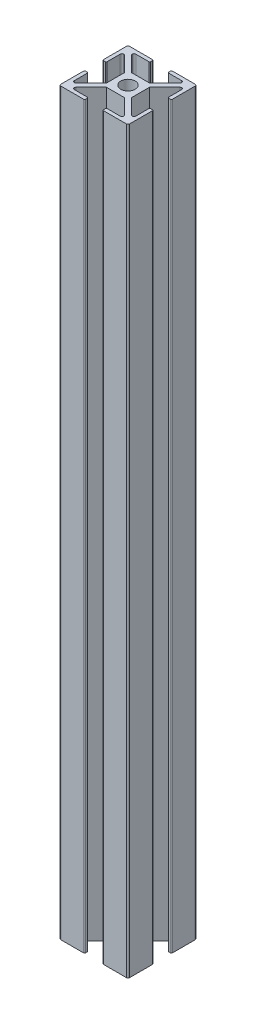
ISO-10303-21;
HEADER;
FILE_DESCRIPTION(('STEP AP214'),'2;1');
FILE_NAME('part.step','',(''),(''),'','','');
FILE_SCHEMA(('AUTOMOTIVE_DESIGN { 1 0 10303 214 1 1 1 1 }'));
ENDSEC;
DATA;
#1=APPLICATION_CONTEXT('core data for automotive mechanical design processes');
#2=APPLICATION_PROTOCOL_DEFINITION('international standard','automotive_design',2000,#1);
#3=PRODUCT_CONTEXT('',#1,'mechanical');
#4=PRODUCT('Part','Part','',(#3));
#5=PRODUCT_RELATED_PRODUCT_CATEGORY('part','',(#4));
#6=PRODUCT_DEFINITION_FORMATION('','',#4);
#7=PRODUCT_DEFINITION_CONTEXT('part definition',#1,'design');
#8=PRODUCT_DEFINITION('design','',#6,#7);
#9=PRODUCT_DEFINITION_SHAPE('','',#8);
#10=(LENGTH_UNIT() NAMED_UNIT(*) SI_UNIT(.MILLI.,.METRE.));
#11=(NAMED_UNIT(*) PLANE_ANGLE_UNIT() SI_UNIT($,.RADIAN.));
#12=(NAMED_UNIT(*) SI_UNIT($,.STERADIAN.) SOLID_ANGLE_UNIT());
#13=UNCERTAINTY_MEASURE_WITH_UNIT(LENGTH_MEASURE(1.E-05),#10,'distance_accuracy_value','');
#14=(GEOMETRIC_REPRESENTATION_CONTEXT(3) GLOBAL_UNCERTAINTY_ASSIGNED_CONTEXT((#13)) GLOBAL_UNIT_ASSIGNED_CONTEXT((#10,
#11,#12)) REPRESENTATION_CONTEXT('',''));
#15=CARTESIAN_POINT('',(0.,0.,0.));
#16=DIRECTION('',(0.,0.,1.));
#17=DIRECTION('',(1.,0.,0.));
#18=AXIS2_PLACEMENT_3D('',#15,#16,#17);
#19=CARTESIAN_POINT('',(0.,215.,-3.66));
#20=DIRECTION('',(0.,0.,-1.));
#21=DIRECTION('',(-1.,0.,0.));
#22=AXIS2_PLACEMENT_3D('',#19,#20,#21);
#23=PLANE('',#22);
#24=DIRECTION('',(1.,0.,0.));
#25=VECTOR('',#24,1.);
#26=CARTESIAN_POINT('',(0.,0.,-3.66));
#27=LINE('',#26,#25);
#28=CARTESIAN_POINT('',(-2.59933982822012,0.,-3.66));
#29=VERTEX_POINT('',#28);
#30=CARTESIAN_POINT('',(2.59933982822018,0.,-3.66));
#31=VERTEX_POINT('',#30);
#32=EDGE_CURVE('E670',#29,#31,#27,.T.);
#33=ORIENTED_EDGE('',*,*,#32,.F.);
#34=DIRECTION('',(0.,-1.,0.));
#35=VECTOR('',#34,1.);
#36=CARTESIAN_POINT('',(-2.59933982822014,215.,-3.66000000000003));
#37=LINE('',#36,#35);
#38=CARTESIAN_POINT('',(-2.59933982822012,215.,-3.66));
#39=VERTEX_POINT('',#38);
#40=EDGE_CURVE('E468',#39,#29,#37,.T.);
#41=ORIENTED_EDGE('',*,*,#40,.F.);
#42=DIRECTION('',(1.,0.,0.));
#43=VECTOR('',#42,1.);
#44=CARTESIAN_POINT('',(0.,215.,-3.66));
#45=LINE('',#44,#43);
#46=CARTESIAN_POINT('',(2.59933982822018,215.,-3.66));
#47=VERTEX_POINT('',#46);
#48=EDGE_CURVE('E456',#39,#47,#45,.T.);
#49=ORIENTED_EDGE('',*,*,#48,.T.);
#50=DIRECTION('',(0.,-1.,0.));
#51=VECTOR('',#50,1.);
#52=CARTESIAN_POINT('',(2.59933982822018,215.,-3.66));
#53=LINE('',#52,#51);
#54=EDGE_CURVE('E688',#47,#31,#53,.T.);
#55=ORIENTED_EDGE('',*,*,#54,.T.);
#56=EDGE_LOOP('',(#33,#41,#49,#55));
#57=FACE_BOUND('',#56,.T.);
#58=ADVANCED_FACE('F41',(#57),#23,.T.);
#59=CARTESIAN_POINT('',(-3.66,215.,0.));
#60=DIRECTION('',(-1.,0.,0.));
#61=DIRECTION('',(0.,0.,1.));
#62=AXIS2_PLACEMENT_3D('',#59,#60,#61);
#63=PLANE('',#62);
#64=DIRECTION('',(0.,0.,-1.));
#65=VECTOR('',#64,1.);
#66=CARTESIAN_POINT('',(-3.66,0.,0.));
#67=LINE('',#66,#65);
#68=CARTESIAN_POINT('',(-3.66000000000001,0.,2.59933982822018));
#69=VERTEX_POINT('',#68);
#70=CARTESIAN_POINT('',(-3.66,0.,-2.59933982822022));
#71=VERTEX_POINT('',#70);
#72=EDGE_CURVE('E672',#69,#71,#67,.T.);
#73=ORIENTED_EDGE('',*,*,#72,.F.);
#74=DIRECTION('',(0.,-1.,0.));
#75=VECTOR('',#74,1.);
#76=CARTESIAN_POINT('',(-3.66,215.,2.59933982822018));
#77=LINE('',#76,#75);
#78=CARTESIAN_POINT('',(-3.66000000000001,215.,2.59933982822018));
#79=VERTEX_POINT('',#78);
#80=EDGE_CURVE('E452',#79,#69,#77,.T.);
#81=ORIENTED_EDGE('',*,*,#80,.F.);
#82=DIRECTION('',(0.,0.,-1.));
#83=VECTOR('',#82,1.);
#84=CARTESIAN_POINT('',(-3.66,215.,0.));
#85=LINE('',#84,#83);
#86=CARTESIAN_POINT('',(-3.66,215.,-2.59933982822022));
#87=VERTEX_POINT('',#86);
#88=EDGE_CURVE('E445',#79,#87,#85,.T.);
#89=ORIENTED_EDGE('',*,*,#88,.T.);
#90=DIRECTION('',(0.,-1.,0.));
#91=VECTOR('',#90,1.);
#92=CARTESIAN_POINT('',(-3.65999999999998,215.,-2.59933982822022));
#93=LINE('',#92,#91);
#94=EDGE_CURVE('E449',#87,#71,#93,.T.);
#95=ORIENTED_EDGE('',*,*,#94,.T.);
#96=EDGE_LOOP('',(#73,#81,#89,#95));
#97=FACE_BOUND('',#96,.T.);
#98=ADVANCED_FACE('F448',(#97),#63,.T.);
#99=CARTESIAN_POINT('',(0.,215.,3.66));
#100=DIRECTION('',(0.,0.,-1.));
#101=DIRECTION('',(-1.,0.,0.));
#102=AXIS2_PLACEMENT_3D('',#99,#100,#101);
#103=PLANE('',#102);
#104=DIRECTION('',(0.,-1.,0.));
#105=VECTOR('',#104,1.);
#106=CARTESIAN_POINT('',(2.59933982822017,215.,3.66000000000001));
#107=LINE('',#106,#105);
#108=CARTESIAN_POINT('',(2.59933982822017,215.,3.66));
#109=VERTEX_POINT('',#108);
#110=CARTESIAN_POINT('',(2.59933982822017,0.,3.66));
#111=VERTEX_POINT('',#110);
#112=EDGE_CURVE('E590',#109,#111,#107,.T.);
#113=ORIENTED_EDGE('',*,*,#112,.F.);
#114=DIRECTION('',(1.,0.,0.));
#115=VECTOR('',#114,1.);
#116=CARTESIAN_POINT('',(0.,215.,3.66));
#117=LINE('',#116,#115);
#118=CARTESIAN_POINT('',(-2.59933982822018,215.,3.65999999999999));
#119=VERTEX_POINT('',#118);
#120=EDGE_CURVE('E455',#119,#109,#117,.T.);
#121=ORIENTED_EDGE('',*,*,#120,.F.);
#122=DIRECTION('',(0.,-1.,0.));
#123=VECTOR('',#122,1.);
#124=CARTESIAN_POINT('',(-2.59933982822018,215.,3.66));
#125=LINE('',#124,#123);
#126=CARTESIAN_POINT('',(-2.59933982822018,0.,3.66));
#127=VERTEX_POINT('',#126);
#128=EDGE_CURVE('E561',#119,#127,#125,.T.);
#129=ORIENTED_EDGE('',*,*,#128,.T.);
#130=DIRECTION('',(1.,0.,0.));
#131=VECTOR('',#130,1.);
#132=CARTESIAN_POINT('',(0.,0.,3.66));
#133=LINE('',#132,#131);
#134=EDGE_CURVE('E674',#127,#111,#133,.T.);
#135=ORIENTED_EDGE('',*,*,#134,.T.);
#136=EDGE_LOOP('',(#113,#121,#129,#135));
#137=FACE_BOUND('',#136,.T.);
#138=ADVANCED_FACE('F1000',(#137),#103,.F.);
#139=CARTESIAN_POINT('',(10.,215.,0.));
#140=DIRECTION('',(1.,0.,0.));
#141=DIRECTION('',(0.,0.,-1.));
#142=AXIS2_PLACEMENT_3D('',#139,#140,#141);
#143=PLANE('',#142);
#144=DIRECTION('',(0.,0.,1.));
#145=VECTOR('',#144,1.);
#146=CARTESIAN_POINT('',(10.,215.,0.));
#147=LINE('',#146,#145);
#148=CARTESIAN_POINT('',(10.,215.,-9.50000000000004));
#149=VERTEX_POINT('',#148);
#150=CARTESIAN_POINT('',(10.,215.,-2.88));
#151=VERTEX_POINT('',#150);
#152=EDGE_CURVE('E622',#149,#151,#147,.T.);
#153=ORIENTED_EDGE('',*,*,#152,.T.);
#154=DIRECTION('',(0.,-1.,0.));
#155=VECTOR('',#154,1.);
#156=CARTESIAN_POINT('',(10.,0.,-2.88));
#157=LINE('',#156,#155);
#158=CARTESIAN_POINT('',(10.,0.,-2.88));
#159=VERTEX_POINT('',#158);
#160=EDGE_CURVE('E751',#151,#159,#157,.T.);
#161=ORIENTED_EDGE('',*,*,#160,.T.);
#162=DIRECTION('',(0.,0.,1.));
#163=VECTOR('',#162,1.);
#164=CARTESIAN_POINT('',(10.,0.,0.));
#165=LINE('',#164,#163);
#166=CARTESIAN_POINT('',(10.,0.,-9.50000000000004));
#167=VERTEX_POINT('',#166);
#168=EDGE_CURVE('E655',#167,#159,#165,.T.);
#169=ORIENTED_EDGE('',*,*,#168,.F.);
#170=DIRECTION('',(0.,-1.,0.));
#171=VECTOR('',#170,1.);
#172=CARTESIAN_POINT('',(10.,215.,-9.50000000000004));
#173=LINE('',#172,#171);
#174=EDGE_CURVE('E706',#167,#149,#173,.F.);
#175=ORIENTED_EDGE('',*,*,#174,.T.);
#176=EDGE_LOOP('',(#153,#161,#169,#175));
#177=FACE_BOUND('',#176,.T.);
#178=ADVANCED_FACE('F1020',(#177),#143,.T.);
#179=CARTESIAN_POINT('',(0.,215.,-10.));
#180=DIRECTION('',(0.,0.,1.));
#181=DIRECTION('',(1.,0.,0.));
#182=AXIS2_PLACEMENT_3D('',#179,#180,#181);
#183=PLANE('',#182);
#184=DIRECTION('',(-1.,0.,0.));
#185=VECTOR('',#184,1.);
#186=CARTESIAN_POINT('',(0.,0.,-10.));
#187=LINE('',#186,#185);
#188=CARTESIAN_POINT('',(9.50000000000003,0.,-10.));
#189=VERTEX_POINT('',#188);
#190=CARTESIAN_POINT('',(2.88,0.,-10.));
#191=VERTEX_POINT('',#190);
#192=EDGE_CURVE('E658',#189,#191,#187,.T.);
#193=ORIENTED_EDGE('',*,*,#192,.T.);
#194=DIRECTION('',(0.,-1.,0.));
#195=VECTOR('',#194,1.);
#196=CARTESIAN_POINT('',(2.88,215.,-10.));
#197=LINE('',#196,#195);
#198=CARTESIAN_POINT('',(2.88,215.,-10.));
#199=VERTEX_POINT('',#198);
#200=EDGE_CURVE('E731',#191,#199,#197,.F.);
#201=ORIENTED_EDGE('',*,*,#200,.T.);
#202=DIRECTION('',(-1.,0.,0.));
#203=VECTOR('',#202,1.);
#204=CARTESIAN_POINT('',(0.,215.,-10.));
#205=LINE('',#204,#203);
#206=CARTESIAN_POINT('',(9.50000000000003,215.,-10.));
#207=VERTEX_POINT('',#206);
#208=EDGE_CURVE('E626',#207,#199,#205,.T.);
#209=ORIENTED_EDGE('',*,*,#208,.F.);
#210=DIRECTION('',(0.,-1.,0.));
#211=VECTOR('',#210,1.);
#212=CARTESIAN_POINT('',(9.50000000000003,0.,-10.));
#213=LINE('',#212,#211);
#214=EDGE_CURVE('E701',#207,#189,#213,.T.);
#215=ORIENTED_EDGE('',*,*,#214,.T.);
#216=EDGE_LOOP('',(#193,#201,#209,#215));
#217=FACE_BOUND('',#216,.T.);
#218=ADVANCED_FACE('F1016',(#217),#183,.F.);
#219=CARTESIAN_POINT('',(2.63,215.,0.));
#220=DIRECTION('',(-1.,0.,0.));
#221=DIRECTION('',(0.,0.,1.));
#222=AXIS2_PLACEMENT_3D('',#219,#220,#221);
#223=PLANE('',#222);
#224=DIRECTION('',(0.,0.,-1.));
#225=VECTOR('',#224,1.);
#226=CARTESIAN_POINT('',(2.63,215.,0.));
#227=LINE('',#226,#225);
#228=CARTESIAN_POINT('',(2.63,215.,-9.18933982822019));
#229=VERTEX_POINT('',#228);
#230=CARTESIAN_POINT('',(2.63,215.,-9.75000000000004));
#231=VERTEX_POINT('',#230);
#232=EDGE_CURVE('E629',#229,#231,#227,.T.);
#233=ORIENTED_EDGE('',*,*,#232,.T.);
#234=DIRECTION('',(0.,-1.,0.));
#235=VECTOR('',#234,1.);
#236=CARTESIAN_POINT('',(2.63,0.,-9.75000000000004));
#237=LINE('',#236,#235);
#238=CARTESIAN_POINT('',(2.63,0.,-9.75000000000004));
#239=VERTEX_POINT('',#238);
#240=EDGE_CURVE('E720',#231,#239,#237,.T.);
#241=ORIENTED_EDGE('',*,*,#240,.T.);
#242=DIRECTION('',(0.,0.,-1.));
#243=VECTOR('',#242,1.);
#244=CARTESIAN_POINT('',(2.63,0.,0.));
#245=LINE('',#244,#243);
#246=CARTESIAN_POINT('',(2.63,0.,-9.18933982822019));
#247=VERTEX_POINT('',#246);
#248=EDGE_CURVE('E661',#247,#239,#245,.T.);
#249=ORIENTED_EDGE('',*,*,#248,.F.);
#250=DIRECTION('',(0.,-1.,0.));
#251=VECTOR('',#250,1.);
#252=CARTESIAN_POINT('',(2.63,215.,-9.18933982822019));
#253=LINE('',#252,#251);
#254=EDGE_CURVE('E718',#247,#229,#253,.F.);
#255=ORIENTED_EDGE('',*,*,#254,.T.);
#256=EDGE_LOOP('',(#233,#241,#249,#255));
#257=FACE_BOUND('',#256,.T.);
#258=ADVANCED_FACE('F1012',(#257),#223,.T.);
#259=CARTESIAN_POINT('',(0.,215.,-8.93933982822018));
#260=DIRECTION('',(0.,0.,1.));
#261=DIRECTION('',(1.,0.,0.));
#262=AXIS2_PLACEMENT_3D('',#259,#260,#261);
#263=PLANE('',#262);
#264=DIRECTION('',(-1.,0.,0.));
#265=VECTOR('',#264,1.);
#266=CARTESIAN_POINT('',(0.,215.,-8.93933982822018));
#267=LINE('',#266,#265);
#268=CARTESIAN_POINT('',(6.67157287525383,215.,-8.93933982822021));
#269=VERTEX_POINT('',#268);
#270=CARTESIAN_POINT('',(2.88,215.,-8.93933982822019));
#271=VERTEX_POINT('',#270);
#272=EDGE_CURVE('E632',#269,#271,#267,.T.);
#273=ORIENTED_EDGE('',*,*,#272,.T.);
#274=DIRECTION('',(0.,-1.,0.));
#275=VECTOR('',#274,1.);
#276=CARTESIAN_POINT('',(2.88,215.,-8.93933982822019));
#277=LINE('',#276,#275);
#278=CARTESIAN_POINT('',(2.88,0.,-8.93933982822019));
#279=VERTEX_POINT('',#278);
#280=EDGE_CURVE('E741',#271,#279,#277,.T.);
#281=ORIENTED_EDGE('',*,*,#280,.T.);
#282=DIRECTION('',(-1.,0.,0.));
#283=VECTOR('',#282,1.);
#284=CARTESIAN_POINT('',(0.,0.,-8.93933982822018));
#285=LINE('',#284,#283);
#286=CARTESIAN_POINT('',(6.67157287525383,0.,-8.93933982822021));
#287=VERTEX_POINT('',#286);
#288=EDGE_CURVE('E664',#287,#279,#285,.T.);
#289=ORIENTED_EDGE('',*,*,#288,.F.);
#290=DIRECTION('',(0.,-1.,0.));
#291=VECTOR('',#290,1.);
#292=CARTESIAN_POINT('',(6.67157287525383,215.,-8.93933982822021));
#293=LINE('',#292,#291);
#294=EDGE_CURVE('E694',#287,#269,#293,.F.);
#295=ORIENTED_EDGE('',*,*,#294,.T.);
#296=EDGE_LOOP('',(#273,#281,#289,#295));
#297=FACE_BOUND('',#296,.T.);
#298=ADVANCED_FACE('F1008',(#297),#263,.T.);
#299=CARTESIAN_POINT('',(-0.530330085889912,215.,-0.530330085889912));
#300=DIRECTION('',(-0.707106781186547,0.,-0.707106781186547));
#301=DIRECTION('',(-0.707106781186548,0.,0.707106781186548));
#302=AXIS2_PLACEMENT_3D('',#299,#300,#301);
#303=PLANE('',#302);
#304=DIRECTION('',(0.707106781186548,0.,-0.707106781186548));
#305=VECTOR('',#304,1.);
#306=CARTESIAN_POINT('',(-0.530330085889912,215.,-0.530330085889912));
#307=LINE('',#306,#305);
#308=CARTESIAN_POINT('',(7.02512626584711,215.,-8.08578643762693));
#309=VERTEX_POINT('',#308);
#310=EDGE_CURVE('E635',#47,#309,#307,.T.);
#311=ORIENTED_EDGE('',*,*,#310,.T.);
#312=DIRECTION('',(0.,-1.,0.));
#313=VECTOR('',#312,1.);
#314=CARTESIAN_POINT('',(7.02512626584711,0.,-8.08578643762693));
#315=LINE('',#314,#313);
#316=CARTESIAN_POINT('',(7.02512626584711,0.,-8.08578643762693));
#317=VERTEX_POINT('',#316);
#318=EDGE_CURVE('E691',#309,#317,#315,.T.);
#319=ORIENTED_EDGE('',*,*,#318,.T.);
#320=DIRECTION('',(0.707106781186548,0.,-0.707106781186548));
#321=VECTOR('',#320,1.);
#322=CARTESIAN_POINT('',(-0.530330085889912,0.,-0.530330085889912));
#323=LINE('',#322,#321);
#324=EDGE_CURVE('E667',#31,#317,#323,.T.);
#325=ORIENTED_EDGE('',*,*,#324,.F.);
#326=ORIENTED_EDGE('',*,*,#54,.F.);
#327=EDGE_LOOP('',(#311,#319,#325,#326));
#328=FACE_BOUND('',#327,.T.);
#329=ADVANCED_FACE('F1004',(#328),#303,.T.);
#330=CARTESIAN_POINT('',(3.66,215.,0.));
#331=DIRECTION('',(-1.,0.,0.));
#332=DIRECTION('',(0.,0.,1.));
#333=AXIS2_PLACEMENT_3D('',#330,#331,#332);
#334=PLANE('',#333);
#335=DIRECTION('',(0.,0.,-1.));
#336=VECTOR('',#335,1.);
#337=CARTESIAN_POINT('',(3.66,215.,0.));
#338=LINE('',#337,#336);
#339=CARTESIAN_POINT('',(3.66,215.,2.59933982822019));
#340=VERTEX_POINT('',#339);
#341=CARTESIAN_POINT('',(3.66,215.,-2.59933982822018));
#342=VERTEX_POINT('',#341);
#343=EDGE_CURVE('E641',#340,#342,#338,.T.);
#344=ORIENTED_EDGE('',*,*,#343,.F.);
#345=DIRECTION('',(0.,-1.,0.));
#346=VECTOR('',#345,1.);
#347=CARTESIAN_POINT('',(3.65999999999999,215.,2.59933982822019));
#348=LINE('',#347,#346);
#349=CARTESIAN_POINT('',(3.65999999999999,0.,2.59933982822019));
#350=VERTEX_POINT('',#349);
#351=EDGE_CURVE('E615',#340,#350,#348,.T.);
#352=ORIENTED_EDGE('',*,*,#351,.T.);
#353=DIRECTION('',(0.,0.,-1.));
#354=VECTOR('',#353,1.);
#355=CARTESIAN_POINT('',(3.66,0.,0.));
#356=LINE('',#355,#354);
#357=CARTESIAN_POINT('',(3.66,0.,-2.59933982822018));
#358=VERTEX_POINT('',#357);
#359=EDGE_CURVE('E676',#350,#358,#356,.T.);
#360=ORIENTED_EDGE('',*,*,#359,.T.);
#361=DIRECTION('',(0.,-1.,0.));
#362=VECTOR('',#361,1.);
#363=CARTESIAN_POINT('',(3.66,215.,-2.59933982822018));
#364=LINE('',#363,#362);
#365=EDGE_CURVE('E652',#342,#358,#364,.T.);
#366=ORIENTED_EDGE('',*,*,#365,.F.);
#367=EDGE_LOOP('',(#344,#352,#360,#366));
#368=FACE_BOUND('',#367,.T.);
#369=ADVANCED_FACE('F1007',(#368),#334,.F.);
#370=CARTESIAN_POINT('',(0.53033008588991,215.,0.53033008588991));
#371=DIRECTION('',(-0.707106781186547,0.,-0.707106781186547));
#372=DIRECTION('',(-0.707106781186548,0.,0.707106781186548));
#373=AXIS2_PLACEMENT_3D('',#370,#371,#372);
#374=PLANE('',#373);
#375=DIRECTION('',(0.707106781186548,0.,-0.707106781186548));
#376=VECTOR('',#375,1.);
#377=CARTESIAN_POINT('',(0.53033008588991,0.,0.53033008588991));
#378=LINE('',#377,#376);
#379=CARTESIAN_POINT('',(8.08578643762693,0.,-7.02512626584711));
#380=VERTEX_POINT('',#379);
#381=EDGE_CURVE('E678',#358,#380,#378,.T.);
#382=ORIENTED_EDGE('',*,*,#381,.T.);
#383=DIRECTION('',(0.,-1.,0.));
#384=VECTOR('',#383,1.);
#385=CARTESIAN_POINT('',(8.08578643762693,215.,-7.02512626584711));
#386=LINE('',#385,#384);
#387=CARTESIAN_POINT('',(8.08578643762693,215.,-7.02512626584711));
#388=VERTEX_POINT('',#387);
#389=EDGE_CURVE('E699',#380,#388,#386,.F.);
#390=ORIENTED_EDGE('',*,*,#389,.T.);
#391=DIRECTION('',(0.707106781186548,0.,-0.707106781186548));
#392=VECTOR('',#391,1.);
#393=CARTESIAN_POINT('',(0.53033008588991,215.,0.53033008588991));
#394=LINE('',#393,#392);
#395=EDGE_CURVE('E643',#342,#388,#394,.T.);
#396=ORIENTED_EDGE('',*,*,#395,.F.);
#397=ORIENTED_EDGE('',*,*,#365,.T.);
#398=EDGE_LOOP('',(#382,#390,#396,#397));
#399=FACE_BOUND('',#398,.T.);
#400=ADVANCED_FACE('F1214',(#399),#374,.F.);
#401=CARTESIAN_POINT('',(8.93933982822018,215.,0.));
#402=DIRECTION('',(1.,0.,0.));
#403=DIRECTION('',(0.,0.,-1.));
#404=AXIS2_PLACEMENT_3D('',#401,#402,#403);
#405=PLANE('',#404);
#406=DIRECTION('',(0.,0.,1.));
#407=VECTOR('',#406,1.);
#408=CARTESIAN_POINT('',(8.93933982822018,0.,0.));
#409=LINE('',#408,#407);
#410=CARTESIAN_POINT('',(8.9393398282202,0.,-6.67157287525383));
#411=VERTEX_POINT('',#410);
#412=CARTESIAN_POINT('',(8.93933982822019,0.,-2.88000000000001));
#413=VERTEX_POINT('',#412);
#414=EDGE_CURVE('E681',#411,#413,#409,.T.);
#415=ORIENTED_EDGE('',*,*,#414,.T.);
#416=DIRECTION('',(0.,-1.,0.));
#417=VECTOR('',#416,1.);
#418=CARTESIAN_POINT('',(8.93933982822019,215.,-2.88000000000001));
#419=LINE('',#418,#417);
#420=CARTESIAN_POINT('',(8.93933982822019,215.,-2.88000000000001));
#421=VERTEX_POINT('',#420);
#422=EDGE_CURVE('E749',#413,#421,#419,.F.);
#423=ORIENTED_EDGE('',*,*,#422,.T.);
#424=DIRECTION('',(0.,0.,1.));
#425=VECTOR('',#424,1.);
#426=CARTESIAN_POINT('',(8.93933982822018,215.,0.));
#427=LINE('',#426,#425);
#428=CARTESIAN_POINT('',(8.9393398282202,215.,-6.67157287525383));
#429=VERTEX_POINT('',#428);
#430=EDGE_CURVE('E646',#429,#421,#427,.T.);
#431=ORIENTED_EDGE('',*,*,#430,.F.);
#432=DIRECTION('',(0.,-1.,0.));
#433=VECTOR('',#432,1.);
#434=CARTESIAN_POINT('',(8.9393398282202,0.,-6.67157287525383));
#435=LINE('',#434,#433);
#436=EDGE_CURVE('E696',#429,#411,#435,.T.);
#437=ORIENTED_EDGE('',*,*,#436,.T.);
#438=EDGE_LOOP('',(#415,#423,#431,#437));
#439=FACE_BOUND('',#438,.T.);
#440=ADVANCED_FACE('F1029',(#439),#405,.F.);
#441=CARTESIAN_POINT('',(0.,215.,0.));
#442=DIRECTION('',(0.,-1.,0.));
#443=DIRECTION('',(0.,0.,-1.));
#444=AXIS2_PLACEMENT_3D('',#441,#442,#443);
#445=CYLINDRICAL_SURFACE('',#444,2.095);
#446=CARTESIAN_POINT('',(0.,215.,0.));
#447=DIRECTION('',(0.,1.,0.));
#448=DIRECTION('',(0.,0.,1.));
#449=AXIS2_PLACEMENT_3D('',#446,#447,#448);
#450=CIRCLE('',#449,2.095);
#451=CARTESIAN_POINT('',(0.,215.,2.095));
#452=VERTEX_POINT('',#451);
#453=EDGE_CURVE('E619',#452,#452,#450,.T.);
#454=ORIENTED_EDGE('',*,*,#453,.T.);
#455=EDGE_LOOP('',(#454));
#456=FACE_BOUND('',#455,.T.);
#457=CARTESIAN_POINT('',(0.,0.,0.));
#458=DIRECTION('',(0.,1.,0.));
#459=DIRECTION('',(0.,0.,1.));
#460=AXIS2_PLACEMENT_3D('',#457,#458,#459);
#461=CIRCLE('',#460,2.095);
#462=CARTESIAN_POINT('',(0.,0.,2.095));
#463=VERTEX_POINT('',#462);
#464=EDGE_CURVE('E618',#463,#463,#461,.T.);
#465=ORIENTED_EDGE('',*,*,#464,.F.);
#466=EDGE_LOOP('',(#465));
#467=FACE_BOUND('',#466,.T.);
#468=ADVANCED_FACE('F1025',(#456,#467),#445,.F.);
#469=CARTESIAN_POINT('',(0.,215.,-2.63000000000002));
#470=DIRECTION('',(0.,0.,-1.));
#471=DIRECTION('',(-1.,0.,0.));
#472=AXIS2_PLACEMENT_3D('',#469,#470,#471);
#473=PLANE('',#472);
#474=DIRECTION('',(1.,0.,0.));
#475=VECTOR('',#474,1.);
#476=CARTESIAN_POINT('',(0.,215.,-2.63000000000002));
#477=LINE('',#476,#475);
#478=CARTESIAN_POINT('',(9.18933982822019,215.,-2.63000000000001));
#479=VERTEX_POINT('',#478);
#480=CARTESIAN_POINT('',(9.75000000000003,215.,-2.63));
#481=VERTEX_POINT('',#480);
#482=EDGE_CURVE('E649',#479,#481,#477,.T.);
#483=ORIENTED_EDGE('',*,*,#482,.F.);
#484=DIRECTION('',(0.,-1.,0.));
#485=VECTOR('',#484,1.);
#486=CARTESIAN_POINT('',(9.18933982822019,215.,-2.63000000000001));
#487=LINE('',#486,#485);
#488=CARTESIAN_POINT('',(9.18933982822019,0.,-2.63000000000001));
#489=VERTEX_POINT('',#488);
#490=EDGE_CURVE('E746',#479,#489,#487,.T.);
#491=ORIENTED_EDGE('',*,*,#490,.T.);
#492=DIRECTION('',(1.,0.,0.));
#493=VECTOR('',#492,1.);
#494=CARTESIAN_POINT('',(0.,0.,-2.63000000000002));
#495=LINE('',#494,#493);
#496=CARTESIAN_POINT('',(9.75000000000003,0.,-2.63));
#497=VERTEX_POINT('',#496);
#498=EDGE_CURVE('E623',#489,#497,#495,.T.);
#499=ORIENTED_EDGE('',*,*,#498,.T.);
#500=DIRECTION('',(0.,-1.,0.));
#501=VECTOR('',#500,1.);
#502=CARTESIAN_POINT('',(9.75000000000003,215.,-2.63));
#503=LINE('',#502,#501);
#504=EDGE_CURVE('E744',#497,#481,#503,.F.);
#505=ORIENTED_EDGE('',*,*,#504,.T.);
#506=EDGE_LOOP('',(#483,#491,#499,#505));
#507=FACE_BOUND('',#506,.T.);
#508=ADVANCED_FACE('F1028',(#507),#473,.F.);
#509=CARTESIAN_POINT('',(0.,215.,0.));
#510=DIRECTION('',(0.,1.,0.));
#511=DIRECTION('',(0.,0.,1.));
#512=AXIS2_PLACEMENT_3D('',#509,#510,#511);
#513=PLANE('',#512);
#514=DIRECTION('',(0.,0.,1.));
#515=VECTOR('',#514,1.);
#516=CARTESIAN_POINT('',(-10.,215.,-1.04744440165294E-13));
#517=LINE('',#516,#515);
#518=CARTESIAN_POINT('',(-9.99999999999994,215.,-9.50000000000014));
#519=VERTEX_POINT('',#518);
#520=CARTESIAN_POINT('',(-10.,215.,-2.88000000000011));
#521=VERTEX_POINT('',#520);
#522=EDGE_CURVE('E959',#519,#521,#517,.T.);
#523=ORIENTED_EDGE('',*,*,#522,.T.);
#524=CARTESIAN_POINT('',(-9.75000000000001,215.,-2.8800000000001));
#525=DIRECTION('',(0.,1.,0.));
#526=DIRECTION('',(0.,0.,1.));
#527=AXIS2_PLACEMENT_3D('',#524,#525,#526);
#528=CIRCLE('',#527,0.25);
#529=CARTESIAN_POINT('',(-9.75000000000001,215.,-2.6300000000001));
#530=VERTEX_POINT('',#529);
#531=EDGE_CURVE('E924',#521,#530,#528,.T.);
#532=ORIENTED_EDGE('',*,*,#531,.T.);
#533=DIRECTION('',(-1.,0.,0.));
#534=VECTOR('',#533,1.);
#535=CARTESIAN_POINT('',(0.,215.,-2.63));
#536=LINE('',#535,#534);
#537=CARTESIAN_POINT('',(-9.18933982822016,215.,-2.6300000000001));
#538=VERTEX_POINT('',#537);
#539=EDGE_CURVE('E481',#538,#530,#536,.T.);
#540=ORIENTED_EDGE('',*,*,#539,.F.);
#541=CARTESIAN_POINT('',(-9.18933982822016,215.,-2.8800000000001));
#542=DIRECTION('',(0.,1.,0.));
#543=DIRECTION('',(0.,0.,1.));
#544=AXIS2_PLACEMENT_3D('',#541,#542,#543);
#545=CIRCLE('',#544,0.25);
#546=CARTESIAN_POINT('',(-8.93933982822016,215.,-2.8800000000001));
#547=VERTEX_POINT('',#546);
#548=EDGE_CURVE('E56',#538,#547,#545,.T.);
#549=ORIENTED_EDGE('',*,*,#548,.T.);
#550=DIRECTION('',(0.,0.,1.));
#551=VECTOR('',#550,1.);
#552=CARTESIAN_POINT('',(-8.93933982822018,215.,0.));
#553=LINE('',#552,#551);
#554=CARTESIAN_POINT('',(-8.93933982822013,215.,-6.67157287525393));
#555=VERTEX_POINT('',#554);
#556=EDGE_CURVE('E476',#555,#547,#553,.T.);
#557=ORIENTED_EDGE('',*,*,#556,.F.);
#558=CARTESIAN_POINT('',(-8.43933982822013,215.,-6.67157287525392));
#559=DIRECTION('',(0.,1.,0.));
#560=DIRECTION('',(0.,0.,1.));
#561=AXIS2_PLACEMENT_3D('',#558,#559,#560);
#562=CIRCLE('',#561,0.5);
#563=CARTESIAN_POINT('',(-8.08578643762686,215.,-7.02512626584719));
#564=VERTEX_POINT('',#563);
#565=EDGE_CURVE('E474',#555,#564,#562,.F.);
#566=ORIENTED_EDGE('',*,*,#565,.T.);
#567=DIRECTION('',(-0.70710678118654,0.,-0.707106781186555));
#568=VECTOR('',#567,1.);
#569=CARTESIAN_POINT('',(-0.530330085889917,215.,0.530330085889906));
#570=LINE('',#569,#568);
#571=EDGE_CURVE('E463',#87,#564,#570,.T.);
#572=ORIENTED_EDGE('',*,*,#571,.F.);
#573=ORIENTED_EDGE('',*,*,#88,.F.);
#574=DIRECTION('',(-0.707106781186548,0.,0.707106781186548));
#575=VECTOR('',#574,1.);
#576=CARTESIAN_POINT('',(-0.53033008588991,215.,-0.53033008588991));
#577=LINE('',#576,#575);
#578=CARTESIAN_POINT('',(-8.08578643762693,215.,7.02512626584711));
#579=VERTEX_POINT('',#578);
#580=EDGE_CURVE('E530',#79,#579,#577,.T.);
#581=ORIENTED_EDGE('',*,*,#580,.T.);
#582=CARTESIAN_POINT('',(-8.4393398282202,215.,6.67157287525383));
#583=DIRECTION('',(0.,1.,0.));
#584=DIRECTION('',(0.,0.,1.));
#585=AXIS2_PLACEMENT_3D('',#582,#583,#584);
#586=CIRCLE('',#585,0.5);
#587=CARTESIAN_POINT('',(-8.9393398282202,215.,6.67157287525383));
#588=VERTEX_POINT('',#587);
#589=EDGE_CURVE('E806',#579,#588,#586,.F.);
#590=ORIENTED_EDGE('',*,*,#589,.T.);
#591=DIRECTION('',(0.,0.,-1.));
#592=VECTOR('',#591,1.);
#593=CARTESIAN_POINT('',(-8.93933982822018,215.,0.));
#594=LINE('',#593,#592);
#595=CARTESIAN_POINT('',(-8.93933982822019,215.,2.88000000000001));
#596=VERTEX_POINT('',#595);
#597=EDGE_CURVE('E532',#588,#596,#594,.T.);
#598=ORIENTED_EDGE('',*,*,#597,.T.);
#599=CARTESIAN_POINT('',(-9.18933982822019,215.,2.88000000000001));
#600=DIRECTION('',(0.,1.,0.));
#601=DIRECTION('',(0.,0.,1.));
#602=AXIS2_PLACEMENT_3D('',#599,#600,#601);
#603=CIRCLE('',#602,0.25);
#604=CARTESIAN_POINT('',(-9.18933982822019,215.,2.63000000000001));
#605=VERTEX_POINT('',#604);
#606=EDGE_CURVE('E886',#596,#605,#603,.T.);
#607=ORIENTED_EDGE('',*,*,#606,.T.);
#608=DIRECTION('',(-1.,0.,0.));
#609=VECTOR('',#608,1.);
#610=CARTESIAN_POINT('',(0.,215.,2.63000000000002));
#611=LINE('',#610,#609);
#612=CARTESIAN_POINT('',(-9.75000000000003,215.,2.63));
#613=VERTEX_POINT('',#612);
#614=EDGE_CURVE('E535',#605,#613,#611,.T.);
#615=ORIENTED_EDGE('',*,*,#614,.T.);
#616=CARTESIAN_POINT('',(-9.75000000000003,215.,2.88));
#617=DIRECTION('',(0.,1.,0.));
#618=DIRECTION('',(0.,0.,1.));
#619=AXIS2_PLACEMENT_3D('',#616,#617,#618);
#620=CIRCLE('',#619,0.25);
#621=CARTESIAN_POINT('',(-10.,215.,2.88));
#622=VERTEX_POINT('',#621);
#623=EDGE_CURVE('E884',#613,#622,#620,.T.);
#624=ORIENTED_EDGE('',*,*,#623,.T.);
#625=DIRECTION('',(0.,0.,-1.));
#626=VECTOR('',#625,1.);
#627=CARTESIAN_POINT('',(-10.,215.,0.));
#628=LINE('',#627,#626);
#629=CARTESIAN_POINT('',(-10.,215.,9.50000000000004));
#630=VERTEX_POINT('',#629);
#631=EDGE_CURVE('E514',#630,#622,#628,.T.);
#632=ORIENTED_EDGE('',*,*,#631,.F.);
#633=CARTESIAN_POINT('',(-9.50000000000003,215.,9.50000000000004));
#634=DIRECTION('',(0.,1.,0.));
#635=DIRECTION('',(0.,0.,1.));
#636=AXIS2_PLACEMENT_3D('',#633,#634,#635);
#637=CIRCLE('',#636,0.5);
#638=CARTESIAN_POINT('',(-9.50000000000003,215.,10.));
#639=VERTEX_POINT('',#638);
#640=EDGE_CURVE('E798',#630,#639,#637,.T.);
#641=ORIENTED_EDGE('',*,*,#640,.T.);
#642=DIRECTION('',(1.,0.,0.));
#643=VECTOR('',#642,1.);
#644=CARTESIAN_POINT('',(0.,215.,10.));
#645=LINE('',#644,#643);
#646=CARTESIAN_POINT('',(-2.88,215.,10.));
#647=VERTEX_POINT('',#646);
#648=EDGE_CURVE('E517',#639,#647,#645,.T.);
#649=ORIENTED_EDGE('',*,*,#648,.T.);
#650=CARTESIAN_POINT('',(-2.88,215.,9.75000000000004));
#651=DIRECTION('',(0.,1.,0.));
#652=DIRECTION('',(0.,0.,1.));
#653=AXIS2_PLACEMENT_3D('',#650,#651,#652);
#654=CIRCLE('',#653,0.25);
#655=CARTESIAN_POINT('',(-2.63,215.,9.75000000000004));
#656=VERTEX_POINT('',#655);
#657=EDGE_CURVE('E890',#647,#656,#654,.T.);
#658=ORIENTED_EDGE('',*,*,#657,.T.);
#659=DIRECTION('',(0.,0.,1.));
#660=VECTOR('',#659,1.);
#661=CARTESIAN_POINT('',(-2.63,215.,0.));
#662=LINE('',#661,#660);
#663=CARTESIAN_POINT('',(-2.63,215.,9.18933982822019));
#664=VERTEX_POINT('',#663);
#665=EDGE_CURVE('E521',#664,#656,#662,.T.);
#666=ORIENTED_EDGE('',*,*,#665,.F.);
#667=CARTESIAN_POINT('',(-2.88,215.,9.18933982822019));
#668=DIRECTION('',(0.,1.,0.));
#669=DIRECTION('',(0.,0.,1.));
#670=AXIS2_PLACEMENT_3D('',#667,#668,#669);
#671=CIRCLE('',#670,0.25);
#672=CARTESIAN_POINT('',(-2.88,215.,8.93933982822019));
#673=VERTEX_POINT('',#672);
#674=EDGE_CURVE('E888',#664,#673,#671,.T.);
#675=ORIENTED_EDGE('',*,*,#674,.T.);
#676=DIRECTION('',(1.,0.,0.));
#677=VECTOR('',#676,1.);
#678=CARTESIAN_POINT('',(0.,215.,8.93933982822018));
#679=LINE('',#678,#677);
#680=CARTESIAN_POINT('',(-6.67157287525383,215.,8.93933982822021));
#681=VERTEX_POINT('',#680);
#682=EDGE_CURVE('E524',#681,#673,#679,.T.);
#683=ORIENTED_EDGE('',*,*,#682,.F.);
#684=CARTESIAN_POINT('',(-6.67157287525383,215.,8.4393398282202));
#685=DIRECTION('',(0.,1.,0.));
#686=DIRECTION('',(0.,0.,1.));
#687=AXIS2_PLACEMENT_3D('',#684,#685,#686);
#688=CIRCLE('',#687,0.5);
#689=CARTESIAN_POINT('',(-7.02512626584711,215.,8.08578643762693));
#690=VERTEX_POINT('',#689);
#691=EDGE_CURVE('E802',#681,#690,#688,.F.);
#692=ORIENTED_EDGE('',*,*,#691,.T.);
#693=DIRECTION('',(-0.707106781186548,0.,0.707106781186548));
#694=VECTOR('',#693,1.);
#695=CARTESIAN_POINT('',(0.530330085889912,215.,0.530330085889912));
#696=LINE('',#695,#694);
#697=EDGE_CURVE('E527',#119,#690,#696,.T.);
#698=ORIENTED_EDGE('',*,*,#697,.F.);
#699=ORIENTED_EDGE('',*,*,#120,.T.);
#700=DIRECTION('',(0.707106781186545,0.,0.70710678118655));
#701=VECTOR('',#700,1.);
#702=CARTESIAN_POINT('',(-0.530330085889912,215.,0.530330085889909));
#703=LINE('',#702,#701);
#704=CARTESIAN_POINT('',(7.02512626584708,215.,8.08578643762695));
#705=VERTEX_POINT('',#704);
#706=EDGE_CURVE('E581',#109,#705,#703,.T.);
#707=ORIENTED_EDGE('',*,*,#706,.T.);
#708=CARTESIAN_POINT('',(6.6715728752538,215.,8.43933982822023));
#709=DIRECTION('',(0.,1.,0.));
#710=DIRECTION('',(0.,0.,1.));
#711=AXIS2_PLACEMENT_3D('',#708,#709,#710);
#712=CIRCLE('',#711,0.5);
#713=CARTESIAN_POINT('',(6.6715728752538,215.,8.93933982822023));
#714=VERTEX_POINT('',#713);
#715=EDGE_CURVE('E779',#705,#714,#712,.F.);
#716=ORIENTED_EDGE('',*,*,#715,.T.);
#717=DIRECTION('',(-1.,0.,0.));
#718=VECTOR('',#717,1.);
#719=CARTESIAN_POINT('',(0.,215.,8.93933982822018));
#720=LINE('',#719,#718);
#721=CARTESIAN_POINT('',(2.87999999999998,215.,8.9393398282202));
#722=VERTEX_POINT('',#721);
#723=EDGE_CURVE('E584',#714,#722,#720,.T.);
#724=ORIENTED_EDGE('',*,*,#723,.T.);
#725=CARTESIAN_POINT('',(2.87999999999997,215.,9.1893398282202));
#726=DIRECTION('',(0.,1.,0.));
#727=DIRECTION('',(0.,0.,1.));
#728=AXIS2_PLACEMENT_3D('',#725,#726,#727);
#729=CIRCLE('',#728,0.25);
#730=CARTESIAN_POINT('',(2.62999999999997,215.,9.1893398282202));
#731=VERTEX_POINT('',#730);
#732=EDGE_CURVE('E850',#722,#731,#729,.T.);
#733=ORIENTED_EDGE('',*,*,#732,.T.);
#734=DIRECTION('',(0.,0.,1.));
#735=VECTOR('',#734,1.);
#736=CARTESIAN_POINT('',(2.63000000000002,215.,0.));
#737=LINE('',#736,#735);
#738=CARTESIAN_POINT('',(2.62999999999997,215.,9.75000000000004));
#739=VERTEX_POINT('',#738);
#740=EDGE_CURVE('E587',#731,#739,#737,.T.);
#741=ORIENTED_EDGE('',*,*,#740,.T.);
#742=CARTESIAN_POINT('',(2.87999999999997,215.,9.75000000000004));
#743=DIRECTION('',(0.,1.,0.));
#744=DIRECTION('',(0.,0.,1.));
#745=AXIS2_PLACEMENT_3D('',#742,#743,#744);
#746=CIRCLE('',#745,0.25);
#747=CARTESIAN_POINT('',(2.87999999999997,215.,10.));
#748=VERTEX_POINT('',#747);
#749=EDGE_CURVE('E848',#739,#748,#746,.T.);
#750=ORIENTED_EDGE('',*,*,#749,.T.);
#751=DIRECTION('',(-1.,0.,0.));
#752=VECTOR('',#751,1.);
#753=CARTESIAN_POINT('',(0.,215.,10.));
#754=LINE('',#753,#752);
#755=CARTESIAN_POINT('',(9.5,215.,10.0000000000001));
#756=VERTEX_POINT('',#755);
#757=EDGE_CURVE('E565',#756,#748,#754,.T.);
#758=ORIENTED_EDGE('',*,*,#757,.F.);
#759=CARTESIAN_POINT('',(9.5,215.,9.50000000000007));
#760=DIRECTION('',(0.,1.,0.));
#761=DIRECTION('',(0.,0.,1.));
#762=AXIS2_PLACEMENT_3D('',#759,#760,#761);
#763=CIRCLE('',#762,0.5);
#764=CARTESIAN_POINT('',(10.,215.,9.50000000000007));
#765=VERTEX_POINT('',#764);
#766=EDGE_CURVE('E771',#756,#765,#763,.T.);
#767=ORIENTED_EDGE('',*,*,#766,.T.);
#768=DIRECTION('',(0.,0.,-1.));
#769=VECTOR('',#768,1.);
#770=CARTESIAN_POINT('',(10.,215.,0.));
#771=LINE('',#770,#769);
#772=CARTESIAN_POINT('',(10.,215.,2.88000000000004));
#773=VERTEX_POINT('',#772);
#774=EDGE_CURVE('E568',#765,#773,#771,.T.);
#775=ORIENTED_EDGE('',*,*,#774,.T.);
#776=CARTESIAN_POINT('',(9.75000000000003,215.,2.88000000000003));
#777=DIRECTION('',(0.,1.,0.));
#778=DIRECTION('',(0.,0.,1.));
#779=AXIS2_PLACEMENT_3D('',#776,#777,#778);
#780=CIRCLE('',#779,0.25);
#781=CARTESIAN_POINT('',(9.75000000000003,215.,2.63000000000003));
#782=VERTEX_POINT('',#781);
#783=EDGE_CURVE('E854',#773,#782,#780,.T.);
#784=ORIENTED_EDGE('',*,*,#783,.T.);
#785=DIRECTION('',(1.,0.,0.));
#786=VECTOR('',#785,1.);
#787=CARTESIAN_POINT('',(0.,215.,2.63));
#788=LINE('',#787,#786);
#789=CARTESIAN_POINT('',(9.18933982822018,215.,2.63000000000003));
#790=VERTEX_POINT('',#789);
#791=EDGE_CURVE('E572',#790,#782,#788,.T.);
#792=ORIENTED_EDGE('',*,*,#791,.F.);
#793=CARTESIAN_POINT('',(9.18933982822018,215.,2.88000000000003));
#794=DIRECTION('',(0.,1.,0.));
#795=DIRECTION('',(0.,0.,1.));
#796=AXIS2_PLACEMENT_3D('',#793,#794,#795);
#797=CIRCLE('',#796,0.25);
#798=CARTESIAN_POINT('',(8.93933982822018,215.,2.88000000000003));
#799=VERTEX_POINT('',#798);
#800=EDGE_CURVE('E852',#790,#799,#797,.T.);
#801=ORIENTED_EDGE('',*,*,#800,.T.);
#802=DIRECTION('',(0.,0.,-1.));
#803=VECTOR('',#802,1.);
#804=CARTESIAN_POINT('',(8.93933982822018,215.,0.));
#805=LINE('',#804,#803);
#806=CARTESIAN_POINT('',(8.93933982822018,215.,6.67157287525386));
#807=VERTEX_POINT('',#806);
#808=EDGE_CURVE('E575',#807,#799,#805,.T.);
#809=ORIENTED_EDGE('',*,*,#808,.F.);
#810=CARTESIAN_POINT('',(8.43933982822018,215.,6.67157287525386));
#811=DIRECTION('',(0.,1.,0.));
#812=DIRECTION('',(0.,0.,1.));
#813=AXIS2_PLACEMENT_3D('',#810,#811,#812);
#814=CIRCLE('',#813,0.5);
#815=CARTESIAN_POINT('',(8.08578643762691,215.,7.02512626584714));
#816=VERTEX_POINT('',#815);
#817=EDGE_CURVE('E775',#807,#816,#814,.F.);
#818=ORIENTED_EDGE('',*,*,#817,.T.);
#819=DIRECTION('',(0.707106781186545,0.,0.70710678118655));
#820=VECTOR('',#819,1.);
#821=CARTESIAN_POINT('',(0.530330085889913,215.,-0.53033008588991));
#822=LINE('',#821,#820);
#823=EDGE_CURVE('E578',#340,#816,#822,.T.);
#824=ORIENTED_EDGE('',*,*,#823,.F.);
#825=ORIENTED_EDGE('',*,*,#343,.T.);
#826=ORIENTED_EDGE('',*,*,#395,.T.);
#827=CARTESIAN_POINT('',(8.4393398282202,215.,-6.67157287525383));
#828=DIRECTION('',(0.,1.,0.));
#829=DIRECTION('',(0.,0.,1.));
#830=AXIS2_PLACEMENT_3D('',#827,#828,#829);
#831=CIRCLE('',#830,0.5);
#832=EDGE_CURVE('E716',#388,#429,#831,.F.);
#833=ORIENTED_EDGE('',*,*,#832,.T.);
#834=ORIENTED_EDGE('',*,*,#430,.T.);
#835=CARTESIAN_POINT('',(9.18933982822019,215.,-2.88000000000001));
#836=DIRECTION('',(0.,1.,0.));
#837=DIRECTION('',(0.,0.,1.));
#838=AXIS2_PLACEMENT_3D('',#835,#836,#837);
#839=CIRCLE('',#838,0.25);
#840=EDGE_CURVE('E735',#421,#479,#839,.T.);
#841=ORIENTED_EDGE('',*,*,#840,.T.);
#842=ORIENTED_EDGE('',*,*,#482,.T.);
#843=CARTESIAN_POINT('',(9.75000000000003,215.,-2.88));
#844=DIRECTION('',(0.,1.,0.));
#845=DIRECTION('',(0.,0.,1.));
#846=AXIS2_PLACEMENT_3D('',#843,#844,#845);
#847=CIRCLE('',#846,0.25);
#848=EDGE_CURVE('E733',#481,#151,#847,.T.);
#849=ORIENTED_EDGE('',*,*,#848,.T.);
#850=ORIENTED_EDGE('',*,*,#152,.F.);
#851=CARTESIAN_POINT('',(9.50000000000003,215.,-9.50000000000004));
#852=DIRECTION('',(0.,1.,0.));
#853=DIRECTION('',(0.,0.,1.));
#854=AXIS2_PLACEMENT_3D('',#851,#852,#853);
#855=CIRCLE('',#854,0.5);
#856=EDGE_CURVE('E708',#149,#207,#855,.T.);
#857=ORIENTED_EDGE('',*,*,#856,.T.);
#858=ORIENTED_EDGE('',*,*,#208,.T.);
#859=CARTESIAN_POINT('',(2.88,215.,-9.75000000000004));
#860=DIRECTION('',(0.,1.,0.));
#861=DIRECTION('',(0.,0.,1.));
#862=AXIS2_PLACEMENT_3D('',#859,#860,#861);
#863=CIRCLE('',#862,0.25);
#864=EDGE_CURVE('E739',#199,#231,#863,.T.);
#865=ORIENTED_EDGE('',*,*,#864,.T.);
#866=ORIENTED_EDGE('',*,*,#232,.F.);
#867=CARTESIAN_POINT('',(2.88,215.,-9.18933982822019));
#868=DIRECTION('',(0.,1.,0.));
#869=DIRECTION('',(0.,0.,1.));
#870=AXIS2_PLACEMENT_3D('',#867,#868,#869);
#871=CIRCLE('',#870,0.25);
#872=EDGE_CURVE('E737',#229,#271,#871,.T.);
#873=ORIENTED_EDGE('',*,*,#872,.T.);
#874=ORIENTED_EDGE('',*,*,#272,.F.);
#875=CARTESIAN_POINT('',(6.67157287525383,215.,-8.4393398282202));
#876=DIRECTION('',(0.,1.,0.));
#877=DIRECTION('',(0.,0.,1.));
#878=AXIS2_PLACEMENT_3D('',#875,#876,#877);
#879=CIRCLE('',#878,0.5);
#880=EDGE_CURVE('E712',#269,#309,#879,.F.);
#881=ORIENTED_EDGE('',*,*,#880,.T.);
#882=ORIENTED_EDGE('',*,*,#310,.F.);
#883=ORIENTED_EDGE('',*,*,#48,.F.);
#884=DIRECTION('',(-0.70710678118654,0.,-0.707106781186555));
#885=VECTOR('',#884,1.);
#886=CARTESIAN_POINT('',(0.530330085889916,215.,-0.530330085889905));
#887=LINE('',#886,#885);
#888=CARTESIAN_POINT('',(-7.02512626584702,215.,-8.085786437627));
#889=VERTEX_POINT('',#888);
#890=EDGE_CURVE('E475',#39,#889,#887,.T.);
#891=ORIENTED_EDGE('',*,*,#890,.T.);
#892=CARTESIAN_POINT('',(-6.67157287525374,215.,-8.43933982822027));
#893=DIRECTION('',(0.,1.,0.));
#894=DIRECTION('',(0.,0.,1.));
#895=AXIS2_PLACEMENT_3D('',#892,#893,#894);
#896=CIRCLE('',#895,0.5);
#897=CARTESIAN_POINT('',(-6.67157287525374,215.,-8.93933982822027));
#898=VERTEX_POINT('',#897);
#899=EDGE_CURVE('E831',#889,#898,#896,.F.);
#900=ORIENTED_EDGE('',*,*,#899,.T.);
#901=DIRECTION('',(1.,0.,0.));
#902=VECTOR('',#901,1.);
#903=CARTESIAN_POINT('',(1.25196248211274E-13,215.,-8.93933982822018));
#904=LINE('',#903,#902);
#905=CARTESIAN_POINT('',(-2.87999999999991,215.,-8.93933982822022));
#906=VERTEX_POINT('',#905);
#907=EDGE_CURVE('E479',#898,#906,#904,.T.);
#908=ORIENTED_EDGE('',*,*,#907,.T.);
#909=CARTESIAN_POINT('',(-2.87999999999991,215.,-9.18933982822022));
#910=DIRECTION('',(0.,1.,0.));
#911=DIRECTION('',(0.,0.,1.));
#912=AXIS2_PLACEMENT_3D('',#909,#910,#911);
#913=CIRCLE('',#912,0.25);
#914=CARTESIAN_POINT('',(-2.62999999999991,215.,-9.18933982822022));
#915=VERTEX_POINT('',#914);
#916=EDGE_CURVE('E921',#906,#915,#913,.T.);
#917=ORIENTED_EDGE('',*,*,#916,.T.);
#918=DIRECTION('',(0.,0.,-1.));
#919=VECTOR('',#918,1.);
#920=CARTESIAN_POINT('',(-2.63000000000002,215.,0.));
#921=LINE('',#920,#919);
#922=CARTESIAN_POINT('',(-2.6299999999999,215.,-9.75000000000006));
#923=VERTEX_POINT('',#922);
#924=EDGE_CURVE('E487',#915,#923,#921,.T.);
#925=ORIENTED_EDGE('',*,*,#924,.T.);
#926=CARTESIAN_POINT('',(-2.8799999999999,215.,-9.75000000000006));
#927=DIRECTION('',(0.,1.,0.));
#928=DIRECTION('',(0.,0.,1.));
#929=AXIS2_PLACEMENT_3D('',#926,#927,#928);
#930=CIRCLE('',#929,0.25);
#931=CARTESIAN_POINT('',(-2.8799999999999,215.,-10.0000000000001));
#932=VERTEX_POINT('',#931);
#933=EDGE_CURVE('E63',#923,#932,#930,.T.);
#934=ORIENTED_EDGE('',*,*,#933,.T.);
#935=DIRECTION('',(1.,0.,0.));
#936=VECTOR('',#935,1.);
#937=CARTESIAN_POINT('',(1.07098203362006E-13,215.,-10.));
#938=LINE('',#937,#936);
#939=CARTESIAN_POINT('',(-9.49999999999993,215.,-10.0000000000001));
#940=VERTEX_POINT('',#939);
#941=EDGE_CURVE('E511',#940,#932,#938,.T.);
#942=ORIENTED_EDGE('',*,*,#941,.F.);
#943=CARTESIAN_POINT('',(-9.49999999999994,215.,-9.50000000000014));
#944=DIRECTION('',(0.,1.,0.));
#945=DIRECTION('',(0.,0.,1.));
#946=AXIS2_PLACEMENT_3D('',#943,#944,#945);
#947=CIRCLE('',#946,0.5);
#948=EDGE_CURVE('E824',#940,#519,#947,.T.);
#949=ORIENTED_EDGE('',*,*,#948,.T.);
#950=EDGE_LOOP('',(#523,#532,#540,#549,#557,#566,#572,#573,#581,#590,#598,#607,#615,#624,#632,
#641,#649,#658,#666,#675,#683,#692,#698,#699,#707,#716,#724,#733,#741,#750,#758,#767,#775,#784,
#792,#801,#809,#818,#824,#825,#826,#833,#834,#841,#842,#849,#850,#857,#858,#865,#866,#873,#874,
#881,#882,#883,#891,#900,#908,#917,#925,#934,#942,#949));
#951=FACE_BOUND('',#950,.T.);
#952=ORIENTED_EDGE('',*,*,#453,.F.);
#953=EDGE_LOOP('',(#952));
#954=FACE_BOUND('',#953,.T.);
#955=ADVANCED_FACE('F471',(#951,#954),#513,.T.);
#956=CARTESIAN_POINT('',(0.,0.,0.));
#957=DIRECTION('',(0.,1.,0.));
#958=DIRECTION('',(0.,0.,1.));
#959=AXIS2_PLACEMENT_3D('',#956,#957,#958);
#960=PLANE('',#959);
#961=DIRECTION('',(-1.,0.,0.));
#962=VECTOR('',#961,1.);
#963=CARTESIAN_POINT('',(0.,0.,-2.63));
#964=LINE('',#963,#962);
#965=CARTESIAN_POINT('',(-9.18933982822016,0.,-2.6300000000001));
#966=VERTEX_POINT('',#965);
#967=CARTESIAN_POINT('',(-9.75000000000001,0.,-2.6300000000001));
#968=VERTEX_POINT('',#967);
#969=EDGE_CURVE('E495',#966,#968,#964,.T.);
#970=ORIENTED_EDGE('',*,*,#969,.T.);
#971=CARTESIAN_POINT('',(-9.75000000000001,0.,-2.8800000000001));
#972=DIRECTION('',(0.,1.,0.));
#973=DIRECTION('',(0.,0.,1.));
#974=AXIS2_PLACEMENT_3D('',#971,#972,#973);
#975=CIRCLE('',#974,0.25);
#976=CARTESIAN_POINT('',(-10.,0.,-2.88000000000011));
#977=VERTEX_POINT('',#976);
#978=EDGE_CURVE('E916',#968,#977,#975,.F.);
#979=ORIENTED_EDGE('',*,*,#978,.T.);
#980=DIRECTION('',(0.,0.,1.));
#981=VECTOR('',#980,1.);
#982=CARTESIAN_POINT('',(-10.,0.,-1.04744440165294E-13));
#983=LINE('',#982,#981);
#984=CARTESIAN_POINT('',(-9.99999999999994,0.,-9.50000000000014));
#985=VERTEX_POINT('',#984);
#986=EDGE_CURVE('E492',#985,#977,#983,.T.);
#987=ORIENTED_EDGE('',*,*,#986,.F.);
#988=CARTESIAN_POINT('',(-9.49999999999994,0.,-9.50000000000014));
#989=DIRECTION('',(0.,1.,0.));
#990=DIRECTION('',(0.,0.,1.));
#991=AXIS2_PLACEMENT_3D('',#988,#989,#990);
#992=CIRCLE('',#991,0.5);
#993=CARTESIAN_POINT('',(-9.49999999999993,0.,-10.0000000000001));
#994=VERTEX_POINT('',#993);
#995=EDGE_CURVE('E820',#985,#994,#992,.F.);
#996=ORIENTED_EDGE('',*,*,#995,.T.);
#997=DIRECTION('',(1.,0.,0.));
#998=VECTOR('',#997,1.);
#999=CARTESIAN_POINT('',(1.07098203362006E-13,0.,-10.));
#1000=LINE('',#999,#998);
#1001=CARTESIAN_POINT('',(-2.8799999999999,0.,-10.0000000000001));
#1002=VERTEX_POINT('',#1001);
#1003=EDGE_CURVE('E489',#994,#1002,#1000,.T.);
#1004=ORIENTED_EDGE('',*,*,#1003,.T.);
#1005=CARTESIAN_POINT('',(-2.8799999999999,0.,-9.75000000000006));
#1006=DIRECTION('',(0.,1.,0.));
#1007=DIRECTION('',(0.,0.,1.));
#1008=AXIS2_PLACEMENT_3D('',#1005,#1006,#1007);
#1009=CIRCLE('',#1008,0.25);
#1010=CARTESIAN_POINT('',(-2.6299999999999,0.,-9.75000000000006));
#1011=VERTEX_POINT('',#1010);
#1012=EDGE_CURVE('E910',#1002,#1011,#1009,.F.);
#1013=ORIENTED_EDGE('',*,*,#1012,.T.);
#1014=DIRECTION('',(0.,0.,-1.));
#1015=VECTOR('',#1014,1.);
#1016=CARTESIAN_POINT('',(-2.63000000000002,0.,0.));
#1017=LINE('',#1016,#1015);
#1018=CARTESIAN_POINT('',(-2.62999999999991,0.,-9.18933982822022));
#1019=VERTEX_POINT('',#1018);
#1020=EDGE_CURVE('E508',#1019,#1011,#1017,.T.);
#1021=ORIENTED_EDGE('',*,*,#1020,.F.);
#1022=CARTESIAN_POINT('',(-2.87999999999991,0.,-9.18933982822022));
#1023=DIRECTION('',(0.,1.,0.));
#1024=DIRECTION('',(0.,0.,1.));
#1025=AXIS2_PLACEMENT_3D('',#1022,#1023,#1024);
#1026=CIRCLE('',#1025,0.25);
#1027=CARTESIAN_POINT('',(-2.87999999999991,0.,-8.93933982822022));
#1028=VERTEX_POINT('',#1027);
#1029=EDGE_CURVE('E912',#1019,#1028,#1026,.F.);
#1030=ORIENTED_EDGE('',*,*,#1029,.T.);
#1031=DIRECTION('',(1.,0.,0.));
#1032=VECTOR('',#1031,1.);
#1033=CARTESIAN_POINT('',(1.25196248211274E-13,0.,-8.93933982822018));
#1034=LINE('',#1033,#1032);
#1035=CARTESIAN_POINT('',(-6.67157287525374,0.,-8.93933982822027));
#1036=VERTEX_POINT('',#1035);
#1037=EDGE_CURVE('E505',#1036,#1028,#1034,.T.);
#1038=ORIENTED_EDGE('',*,*,#1037,.F.);
#1039=CARTESIAN_POINT('',(-6.67157287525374,0.,-8.43933982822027));
#1040=DIRECTION('',(0.,1.,0.));
#1041=DIRECTION('',(0.,0.,1.));
#1042=AXIS2_PLACEMENT_3D('',#1039,#1040,#1041);
#1043=CIRCLE('',#1042,0.5);
#1044=CARTESIAN_POINT('',(-7.02512626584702,0.,-8.085786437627));
#1045=VERTEX_POINT('',#1044);
#1046=EDGE_CURVE('E829',#1036,#1045,#1043,.T.);
#1047=ORIENTED_EDGE('',*,*,#1046,.T.);
#1048=DIRECTION('',(-0.70710678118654,0.,-0.707106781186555));
#1049=VECTOR('',#1048,1.);
#1050=CARTESIAN_POINT('',(0.530330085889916,0.,-0.530330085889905));
#1051=LINE('',#1050,#1049);
#1052=EDGE_CURVE('E502',#29,#1045,#1051,.T.);
#1053=ORIENTED_EDGE('',*,*,#1052,.F.);
#1054=ORIENTED_EDGE('',*,*,#32,.T.);
#1055=ORIENTED_EDGE('',*,*,#324,.T.);
#1056=CARTESIAN_POINT('',(6.67157287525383,0.,-8.4393398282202));
#1057=DIRECTION('',(0.,1.,0.));
#1058=DIRECTION('',(0.,0.,1.));
#1059=AXIS2_PLACEMENT_3D('',#1056,#1057,#1058);
#1060=CIRCLE('',#1059,0.5);
#1061=EDGE_CURVE('E710',#317,#287,#1060,.T.);
#1062=ORIENTED_EDGE('',*,*,#1061,.T.);
#1063=ORIENTED_EDGE('',*,*,#288,.T.);
#1064=CARTESIAN_POINT('',(2.88,0.,-9.18933982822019));
#1065=DIRECTION('',(0.,1.,0.));
#1066=DIRECTION('',(0.,0.,1.));
#1067=AXIS2_PLACEMENT_3D('',#1064,#1065,#1066);
#1068=CIRCLE('',#1067,0.25);
#1069=EDGE_CURVE('E727',#279,#247,#1068,.F.);
#1070=ORIENTED_EDGE('',*,*,#1069,.T.);
#1071=ORIENTED_EDGE('',*,*,#248,.T.);
#1072=CARTESIAN_POINT('',(2.88,0.,-9.75000000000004));
#1073=DIRECTION('',(0.,1.,0.));
#1074=DIRECTION('',(0.,0.,1.));
#1075=AXIS2_PLACEMENT_3D('',#1072,#1073,#1074);
#1076=CIRCLE('',#1075,0.25);
#1077=EDGE_CURVE('E729',#239,#191,#1076,.F.);
#1078=ORIENTED_EDGE('',*,*,#1077,.T.);
#1079=ORIENTED_EDGE('',*,*,#192,.F.);
#1080=CARTESIAN_POINT('',(9.50000000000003,0.,-9.50000000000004));
#1081=DIRECTION('',(0.,1.,0.));
#1082=DIRECTION('',(0.,0.,1.));
#1083=AXIS2_PLACEMENT_3D('',#1080,#1081,#1082);
#1084=CIRCLE('',#1083,0.5);
#1085=EDGE_CURVE('E704',#189,#167,#1084,.F.);
#1086=ORIENTED_EDGE('',*,*,#1085,.T.);
#1087=ORIENTED_EDGE('',*,*,#168,.T.);
#1088=CARTESIAN_POINT('',(9.75000000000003,0.,-2.88));
#1089=DIRECTION('',(0.,1.,0.));
#1090=DIRECTION('',(0.,0.,1.));
#1091=AXIS2_PLACEMENT_3D('',#1088,#1089,#1090);
#1092=CIRCLE('',#1091,0.25);
#1093=EDGE_CURVE('E723',#159,#497,#1092,.F.);
#1094=ORIENTED_EDGE('',*,*,#1093,.T.);
#1095=ORIENTED_EDGE('',*,*,#498,.F.);
#1096=CARTESIAN_POINT('',(9.18933982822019,0.,-2.88000000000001));
#1097=DIRECTION('',(0.,1.,0.));
#1098=DIRECTION('',(0.,0.,1.));
#1099=AXIS2_PLACEMENT_3D('',#1096,#1097,#1098);
#1100=CIRCLE('',#1099,0.25);
#1101=EDGE_CURVE('E725',#489,#413,#1100,.F.);
#1102=ORIENTED_EDGE('',*,*,#1101,.T.);
#1103=ORIENTED_EDGE('',*,*,#414,.F.);
#1104=CARTESIAN_POINT('',(8.4393398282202,0.,-6.67157287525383));
#1105=DIRECTION('',(0.,1.,0.));
#1106=DIRECTION('',(0.,0.,1.));
#1107=AXIS2_PLACEMENT_3D('',#1104,#1105,#1106);
#1108=CIRCLE('',#1107,0.5);
#1109=EDGE_CURVE('E714',#411,#380,#1108,.T.);
#1110=ORIENTED_EDGE('',*,*,#1109,.T.);
#1111=ORIENTED_EDGE('',*,*,#381,.F.);
#1112=ORIENTED_EDGE('',*,*,#359,.F.);
#1113=DIRECTION('',(0.707106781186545,0.,0.70710678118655));
#1114=VECTOR('',#1113,1.);
#1115=CARTESIAN_POINT('',(0.530330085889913,0.,-0.53033008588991));
#1116=LINE('',#1115,#1114);
#1117=CARTESIAN_POINT('',(8.08578643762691,0.,7.02512626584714));
#1118=VERTEX_POINT('',#1117);
#1119=EDGE_CURVE('E602',#350,#1118,#1116,.T.);
#1120=ORIENTED_EDGE('',*,*,#1119,.T.);
#1121=CARTESIAN_POINT('',(8.43933982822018,0.,6.67157287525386));
#1122=DIRECTION('',(0.,1.,0.));
#1123=DIRECTION('',(0.,0.,1.));
#1124=AXIS2_PLACEMENT_3D('',#1121,#1122,#1123);
#1125=CIRCLE('',#1124,0.5);
#1126=CARTESIAN_POINT('',(8.93933982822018,0.,6.67157287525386));
#1127=VERTEX_POINT('',#1126);
#1128=EDGE_CURVE('E773',#1118,#1127,#1125,.T.);
#1129=ORIENTED_EDGE('',*,*,#1128,.T.);
#1130=DIRECTION('',(0.,0.,-1.));
#1131=VECTOR('',#1130,1.);
#1132=CARTESIAN_POINT('',(8.93933982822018,0.,0.));
#1133=LINE('',#1132,#1131);
#1134=CARTESIAN_POINT('',(8.93933982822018,0.,2.88000000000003));
#1135=VERTEX_POINT('',#1134);
#1136=EDGE_CURVE('E599',#1127,#1135,#1133,.T.);
#1137=ORIENTED_EDGE('',*,*,#1136,.T.);
#1138=CARTESIAN_POINT('',(9.18933982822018,0.,2.88000000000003));
#1139=DIRECTION('',(0.,1.,0.));
#1140=DIRECTION('',(0.,0.,1.));
#1141=AXIS2_PLACEMENT_3D('',#1138,#1139,#1140);
#1142=CIRCLE('',#1141,0.25);
#1143=CARTESIAN_POINT('',(9.18933982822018,0.,2.63000000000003));
#1144=VERTEX_POINT('',#1143);
#1145=EDGE_CURVE('E842',#1135,#1144,#1142,.F.);
#1146=ORIENTED_EDGE('',*,*,#1145,.T.);
#1147=DIRECTION('',(1.,0.,0.));
#1148=VECTOR('',#1147,1.);
#1149=CARTESIAN_POINT('',(0.,0.,2.63));
#1150=LINE('',#1149,#1148);
#1151=CARTESIAN_POINT('',(9.75000000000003,0.,2.63000000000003));
#1152=VERTEX_POINT('',#1151);
#1153=EDGE_CURVE('E596',#1144,#1152,#1150,.T.);
#1154=ORIENTED_EDGE('',*,*,#1153,.T.);
#1155=CARTESIAN_POINT('',(9.75000000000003,0.,2.88000000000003));
#1156=DIRECTION('',(0.,1.,0.));
#1157=DIRECTION('',(0.,0.,1.));
#1158=AXIS2_PLACEMENT_3D('',#1155,#1156,#1157);
#1159=CIRCLE('',#1158,0.25);
#1160=CARTESIAN_POINT('',(10.,0.,2.88000000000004));
#1161=VERTEX_POINT('',#1160);
#1162=EDGE_CURVE('E844',#1152,#1161,#1159,.F.);
#1163=ORIENTED_EDGE('',*,*,#1162,.T.);
#1164=DIRECTION('',(0.,0.,-1.));
#1165=VECTOR('',#1164,1.);
#1166=CARTESIAN_POINT('',(10.,0.,0.));
#1167=LINE('',#1166,#1165);
#1168=CARTESIAN_POINT('',(10.,0.,9.50000000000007));
#1169=VERTEX_POINT('',#1168);
#1170=EDGE_CURVE('E593',#1169,#1161,#1167,.T.);
#1171=ORIENTED_EDGE('',*,*,#1170,.F.);
#1172=CARTESIAN_POINT('',(9.5,0.,9.50000000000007));
#1173=DIRECTION('',(0.,1.,0.));
#1174=DIRECTION('',(0.,0.,1.));
#1175=AXIS2_PLACEMENT_3D('',#1172,#1173,#1174);
#1176=CIRCLE('',#1175,0.5);
#1177=CARTESIAN_POINT('',(9.5,0.,10.0000000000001));
#1178=VERTEX_POINT('',#1177);
#1179=EDGE_CURVE('E767',#1169,#1178,#1176,.F.);
#1180=ORIENTED_EDGE('',*,*,#1179,.T.);
#1181=DIRECTION('',(-1.,0.,0.));
#1182=VECTOR('',#1181,1.);
#1183=CARTESIAN_POINT('',(0.,0.,10.));
#1184=LINE('',#1183,#1182);
#1185=CARTESIAN_POINT('',(2.87999999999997,0.,10.));
#1186=VERTEX_POINT('',#1185);
#1187=EDGE_CURVE('E564',#1178,#1186,#1184,.T.);
#1188=ORIENTED_EDGE('',*,*,#1187,.T.);
#1189=CARTESIAN_POINT('',(2.87999999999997,0.,9.75000000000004));
#1190=DIRECTION('',(0.,1.,0.));
#1191=DIRECTION('',(0.,0.,1.));
#1192=AXIS2_PLACEMENT_3D('',#1189,#1190,#1191);
#1193=CIRCLE('',#1192,0.25);
#1194=CARTESIAN_POINT('',(2.62999999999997,0.,9.75000000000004));
#1195=VERTEX_POINT('',#1194);
#1196=EDGE_CURVE('E838',#1186,#1195,#1193,.F.);
#1197=ORIENTED_EDGE('',*,*,#1196,.T.);
#1198=DIRECTION('',(0.,0.,1.));
#1199=VECTOR('',#1198,1.);
#1200=CARTESIAN_POINT('',(2.63000000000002,0.,0.));
#1201=LINE('',#1200,#1199);
#1202=CARTESIAN_POINT('',(2.62999999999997,0.,9.1893398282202));
#1203=VERTEX_POINT('',#1202);
#1204=EDGE_CURVE('E569',#1203,#1195,#1201,.T.);
#1205=ORIENTED_EDGE('',*,*,#1204,.F.);
#1206=CARTESIAN_POINT('',(2.87999999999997,0.,9.1893398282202));
#1207=DIRECTION('',(0.,1.,0.));
#1208=DIRECTION('',(0.,0.,1.));
#1209=AXIS2_PLACEMENT_3D('',#1206,#1207,#1208);
#1210=CIRCLE('',#1209,0.25);
#1211=CARTESIAN_POINT('',(2.87999999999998,0.,8.9393398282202));
#1212=VERTEX_POINT('',#1211);
#1213=EDGE_CURVE('E840',#1203,#1212,#1210,.F.);
#1214=ORIENTED_EDGE('',*,*,#1213,.T.);
#1215=DIRECTION('',(-1.,0.,0.));
#1216=VECTOR('',#1215,1.);
#1217=CARTESIAN_POINT('',(0.,0.,8.93933982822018));
#1218=LINE('',#1217,#1216);
#1219=CARTESIAN_POINT('',(6.6715728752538,0.,8.93933982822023));
#1220=VERTEX_POINT('',#1219);
#1221=EDGE_CURVE('E608',#1220,#1212,#1218,.T.);
#1222=ORIENTED_EDGE('',*,*,#1221,.F.);
#1223=CARTESIAN_POINT('',(6.6715728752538,0.,8.43933982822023));
#1224=DIRECTION('',(0.,1.,0.));
#1225=DIRECTION('',(0.,0.,1.));
#1226=AXIS2_PLACEMENT_3D('',#1223,#1224,#1225);
#1227=CIRCLE('',#1226,0.5);
#1228=CARTESIAN_POINT('',(7.02512626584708,0.,8.08578643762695));
#1229=VERTEX_POINT('',#1228);
#1230=EDGE_CURVE('E777',#1220,#1229,#1227,.T.);
#1231=ORIENTED_EDGE('',*,*,#1230,.T.);
#1232=DIRECTION('',(0.707106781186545,0.,0.70710678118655));
#1233=VECTOR('',#1232,1.);
#1234=CARTESIAN_POINT('',(-0.530330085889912,0.,0.530330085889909));
#1235=LINE('',#1234,#1233);
#1236=EDGE_CURVE('E605',#111,#1229,#1235,.T.);
#1237=ORIENTED_EDGE('',*,*,#1236,.F.);
#1238=ORIENTED_EDGE('',*,*,#134,.F.);
#1239=DIRECTION('',(-0.707106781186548,0.,0.707106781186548));
#1240=VECTOR('',#1239,1.);
#1241=CARTESIAN_POINT('',(0.530330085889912,0.,0.530330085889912));
#1242=LINE('',#1241,#1240);
#1243=CARTESIAN_POINT('',(-7.02512626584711,0.,8.08578643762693));
#1244=VERTEX_POINT('',#1243);
#1245=EDGE_CURVE('E549',#127,#1244,#1242,.T.);
#1246=ORIENTED_EDGE('',*,*,#1245,.T.);
#1247=CARTESIAN_POINT('',(-6.67157287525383,0.,8.4393398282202));
#1248=DIRECTION('',(0.,1.,0.));
#1249=DIRECTION('',(0.,0.,1.));
#1250=AXIS2_PLACEMENT_3D('',#1247,#1248,#1249);
#1251=CIRCLE('',#1250,0.5);
#1252=CARTESIAN_POINT('',(-6.67157287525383,0.,8.93933982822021));
#1253=VERTEX_POINT('',#1252);
#1254=EDGE_CURVE('E800',#1244,#1253,#1251,.T.);
#1255=ORIENTED_EDGE('',*,*,#1254,.T.);
#1256=DIRECTION('',(1.,0.,0.));
#1257=VECTOR('',#1256,1.);
#1258=CARTESIAN_POINT('',(0.,0.,8.93933982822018));
#1259=LINE('',#1258,#1257);
#1260=CARTESIAN_POINT('',(-2.88,0.,8.93933982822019));
#1261=VERTEX_POINT('',#1260);
#1262=EDGE_CURVE('E546',#1253,#1261,#1259,.T.);
#1263=ORIENTED_EDGE('',*,*,#1262,.T.);
#1264=CARTESIAN_POINT('',(-2.88,0.,9.18933982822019));
#1265=DIRECTION('',(0.,1.,0.));
#1266=DIRECTION('',(0.,0.,1.));
#1267=AXIS2_PLACEMENT_3D('',#1264,#1265,#1266);
#1268=CIRCLE('',#1267,0.25);
#1269=CARTESIAN_POINT('',(-2.63,0.,9.18933982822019));
#1270=VERTEX_POINT('',#1269);
#1271=EDGE_CURVE('E878',#1261,#1270,#1268,.F.);
#1272=ORIENTED_EDGE('',*,*,#1271,.T.);
#1273=DIRECTION('',(0.,0.,1.));
#1274=VECTOR('',#1273,1.);
#1275=CARTESIAN_POINT('',(-2.63,0.,0.));
#1276=LINE('',#1275,#1274);
#1277=CARTESIAN_POINT('',(-2.63,0.,9.75000000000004));
#1278=VERTEX_POINT('',#1277);
#1279=EDGE_CURVE('E543',#1270,#1278,#1276,.T.);
#1280=ORIENTED_EDGE('',*,*,#1279,.T.);
#1281=CARTESIAN_POINT('',(-2.88,0.,9.75000000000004));
#1282=DIRECTION('',(0.,1.,0.));
#1283=DIRECTION('',(0.,0.,1.));
#1284=AXIS2_PLACEMENT_3D('',#1281,#1282,#1283);
#1285=CIRCLE('',#1284,0.25);
#1286=CARTESIAN_POINT('',(-2.88,0.,10.));
#1287=VERTEX_POINT('',#1286);
#1288=EDGE_CURVE('E880',#1278,#1287,#1285,.F.);
#1289=ORIENTED_EDGE('',*,*,#1288,.T.);
#1290=DIRECTION('',(1.,0.,0.));
#1291=VECTOR('',#1290,1.);
#1292=CARTESIAN_POINT('',(0.,0.,10.));
#1293=LINE('',#1292,#1291);
#1294=CARTESIAN_POINT('',(-9.50000000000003,0.,10.));
#1295=VERTEX_POINT('',#1294);
#1296=EDGE_CURVE('E540',#1295,#1287,#1293,.T.);
#1297=ORIENTED_EDGE('',*,*,#1296,.F.);
#1298=CARTESIAN_POINT('',(-9.50000000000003,0.,9.50000000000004));
#1299=DIRECTION('',(0.,1.,0.));
#1300=DIRECTION('',(0.,0.,1.));
#1301=AXIS2_PLACEMENT_3D('',#1298,#1299,#1300);
#1302=CIRCLE('',#1301,0.5);
#1303=CARTESIAN_POINT('',(-10.,0.,9.50000000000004));
#1304=VERTEX_POINT('',#1303);
#1305=EDGE_CURVE('E794',#1295,#1304,#1302,.F.);
#1306=ORIENTED_EDGE('',*,*,#1305,.T.);
#1307=DIRECTION('',(0.,0.,-1.));
#1308=VECTOR('',#1307,1.);
#1309=CARTESIAN_POINT('',(-10.,0.,0.));
#1310=LINE('',#1309,#1308);
#1311=CARTESIAN_POINT('',(-10.,0.,2.88));
#1312=VERTEX_POINT('',#1311);
#1313=EDGE_CURVE('E467',#1304,#1312,#1310,.T.);
#1314=ORIENTED_EDGE('',*,*,#1313,.T.);
#1315=CARTESIAN_POINT('',(-9.75000000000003,0.,2.88));
#1316=DIRECTION('',(0.,1.,0.));
#1317=DIRECTION('',(0.,0.,1.));
#1318=AXIS2_PLACEMENT_3D('',#1315,#1316,#1317);
#1319=CIRCLE('',#1318,0.25);
#1320=CARTESIAN_POINT('',(-9.75000000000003,0.,2.63));
#1321=VERTEX_POINT('',#1320);
#1322=EDGE_CURVE('E874',#1312,#1321,#1319,.F.);
#1323=ORIENTED_EDGE('',*,*,#1322,.T.);
#1324=DIRECTION('',(-1.,0.,0.));
#1325=VECTOR('',#1324,1.);
#1326=CARTESIAN_POINT('',(0.,0.,2.63000000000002));
#1327=LINE('',#1326,#1325);
#1328=CARTESIAN_POINT('',(-9.18933982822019,0.,2.63000000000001));
#1329=VERTEX_POINT('',#1328);
#1330=EDGE_CURVE('E518',#1329,#1321,#1327,.T.);
#1331=ORIENTED_EDGE('',*,*,#1330,.F.);
#1332=CARTESIAN_POINT('',(-9.18933982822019,0.,2.88000000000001));
#1333=DIRECTION('',(0.,1.,0.));
#1334=DIRECTION('',(0.,0.,1.));
#1335=AXIS2_PLACEMENT_3D('',#1332,#1333,#1334);
#1336=CIRCLE('',#1335,0.25);
#1337=CARTESIAN_POINT('',(-8.93933982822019,0.,2.88000000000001));
#1338=VERTEX_POINT('',#1337);
#1339=EDGE_CURVE('E876',#1329,#1338,#1336,.F.);
#1340=ORIENTED_EDGE('',*,*,#1339,.T.);
#1341=DIRECTION('',(0.,0.,-1.));
#1342=VECTOR('',#1341,1.);
#1343=CARTESIAN_POINT('',(-8.93933982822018,0.,0.));
#1344=LINE('',#1343,#1342);
#1345=CARTESIAN_POINT('',(-8.9393398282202,0.,6.67157287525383));
#1346=VERTEX_POINT('',#1345);
#1347=EDGE_CURVE('E555',#1346,#1338,#1344,.T.);
#1348=ORIENTED_EDGE('',*,*,#1347,.F.);
#1349=CARTESIAN_POINT('',(-8.4393398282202,0.,6.67157287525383));
#1350=DIRECTION('',(0.,1.,0.));
#1351=DIRECTION('',(0.,0.,1.));
#1352=AXIS2_PLACEMENT_3D('',#1349,#1350,#1351);
#1353=CIRCLE('',#1352,0.5);
#1354=CARTESIAN_POINT('',(-8.08578643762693,0.,7.02512626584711));
#1355=VERTEX_POINT('',#1354);
#1356=EDGE_CURVE('E804',#1346,#1355,#1353,.T.);
#1357=ORIENTED_EDGE('',*,*,#1356,.T.);
#1358=DIRECTION('',(-0.707106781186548,0.,0.707106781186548));
#1359=VECTOR('',#1358,1.);
#1360=CARTESIAN_POINT('',(-0.53033008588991,0.,-0.53033008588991));
#1361=LINE('',#1360,#1359);
#1362=EDGE_CURVE('E552',#69,#1355,#1361,.T.);
#1363=ORIENTED_EDGE('',*,*,#1362,.F.);
#1364=ORIENTED_EDGE('',*,*,#72,.T.);
#1365=DIRECTION('',(-0.70710678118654,0.,-0.707106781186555));
#1366=VECTOR('',#1365,1.);
#1367=CARTESIAN_POINT('',(-0.530330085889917,0.,0.530330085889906));
#1368=LINE('',#1367,#1366);
#1369=CARTESIAN_POINT('',(-8.08578643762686,0.,-7.02512626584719));
#1370=VERTEX_POINT('',#1369);
#1371=EDGE_CURVE('E466',#71,#1370,#1368,.T.);
#1372=ORIENTED_EDGE('',*,*,#1371,.T.);
#1373=CARTESIAN_POINT('',(-8.43933982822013,0.,-6.67157287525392));
#1374=DIRECTION('',(0.,1.,0.));
#1375=DIRECTION('',(0.,0.,1.));
#1376=AXIS2_PLACEMENT_3D('',#1373,#1374,#1375);
#1377=CIRCLE('',#1376,0.5);
#1378=CARTESIAN_POINT('',(-8.93933982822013,0.,-6.67157287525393));
#1379=VERTEX_POINT('',#1378);
#1380=EDGE_CURVE('E826',#1370,#1379,#1377,.T.);
#1381=ORIENTED_EDGE('',*,*,#1380,.T.);
#1382=DIRECTION('',(0.,0.,1.));
#1383=VECTOR('',#1382,1.);
#1384=CARTESIAN_POINT('',(-8.93933982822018,0.,0.));
#1385=LINE('',#1384,#1383);
#1386=CARTESIAN_POINT('',(-8.93933982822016,0.,-2.8800000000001));
#1387=VERTEX_POINT('',#1386);
#1388=EDGE_CURVE('E498',#1379,#1387,#1385,.T.);
#1389=ORIENTED_EDGE('',*,*,#1388,.T.);
#1390=CARTESIAN_POINT('',(-9.18933982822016,0.,-2.8800000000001));
#1391=DIRECTION('',(0.,1.,0.));
#1392=DIRECTION('',(0.,0.,1.));
#1393=AXIS2_PLACEMENT_3D('',#1390,#1391,#1392);
#1394=CIRCLE('',#1393,0.25);
#1395=EDGE_CURVE('E914',#1387,#966,#1394,.F.);
#1396=ORIENTED_EDGE('',*,*,#1395,.T.);
#1397=EDGE_LOOP('',(#970,#979,#987,#996,#1004,#1013,#1021,#1030,#1038,#1047,#1053,#1054,#1055,
#1062,#1063,#1070,#1071,#1078,#1079,#1086,#1087,#1094,#1095,#1102,#1103,#1110,#1111,#1112,#1120,
#1129,#1137,#1146,#1154,#1163,#1171,#1180,#1188,#1197,#1205,#1214,#1222,#1231,#1237,#1238,#1246,
#1255,#1263,#1272,#1280,#1289,#1297,#1306,#1314,#1323,#1331,#1340,#1348,#1357,#1363,#1364,#1372,
#1381,#1389,#1396));
#1398=FACE_BOUND('',#1397,.T.);
#1399=ORIENTED_EDGE('',*,*,#464,.T.);
#1400=EDGE_LOOP('',(#1399));
#1401=FACE_BOUND('',#1400,.T.);
#1402=ADVANCED_FACE('F950',(#1398,#1401),#960,.F.);
#1403=CARTESIAN_POINT('',(6.67157287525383,215.,-8.4393398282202));
#1404=DIRECTION('',(0.,1.,0.));
#1405=DIRECTION('',(0.,0.,1.));
#1406=AXIS2_PLACEMENT_3D('',#1403,#1404,#1405);
#1407=CYLINDRICAL_SURFACE('',#1406,0.5);
#1408=ORIENTED_EDGE('',*,*,#880,.F.);
#1409=ORIENTED_EDGE('',*,*,#294,.F.);
#1410=ORIENTED_EDGE('',*,*,#1061,.F.);
#1411=ORIENTED_EDGE('',*,*,#318,.F.);
#1412=EDGE_LOOP('',(#1408,#1409,#1410,#1411));
#1413=FACE_BOUND('',#1412,.T.);
#1414=ADVANCED_FACE('F1031',(#1413),#1407,.F.);
#1415=CARTESIAN_POINT('',(8.4393398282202,215.,-6.67157287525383));
#1416=DIRECTION('',(0.,1.,0.));
#1417=DIRECTION('',(0.,0.,1.));
#1418=AXIS2_PLACEMENT_3D('',#1415,#1416,#1417);
#1419=CYLINDRICAL_SURFACE('',#1418,0.5);
#1420=ORIENTED_EDGE('',*,*,#832,.F.);
#1421=ORIENTED_EDGE('',*,*,#389,.F.);
#1422=ORIENTED_EDGE('',*,*,#1109,.F.);
#1423=ORIENTED_EDGE('',*,*,#436,.F.);
#1424=EDGE_LOOP('',(#1420,#1421,#1422,#1423));
#1425=FACE_BOUND('',#1424,.T.);
#1426=ADVANCED_FACE('F1034',(#1425),#1419,.F.);
#1427=CARTESIAN_POINT('',(9.50000000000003,215.,-9.50000000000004));
#1428=DIRECTION('',(0.,1.,0.));
#1429=DIRECTION('',(0.,0.,1.));
#1430=AXIS2_PLACEMENT_3D('',#1427,#1428,#1429);
#1431=CYLINDRICAL_SURFACE('',#1430,0.5);
#1432=ORIENTED_EDGE('',*,*,#856,.F.);
#1433=ORIENTED_EDGE('',*,*,#174,.F.);
#1434=ORIENTED_EDGE('',*,*,#1085,.F.);
#1435=ORIENTED_EDGE('',*,*,#214,.F.);
#1436=EDGE_LOOP('',(#1432,#1433,#1434,#1435));
#1437=FACE_BOUND('',#1436,.T.);
#1438=ADVANCED_FACE('F1038',(#1437),#1431,.T.);
#1439=CARTESIAN_POINT('',(2.88,215.,-9.75000000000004));
#1440=DIRECTION('',(0.,1.,0.));
#1441=DIRECTION('',(0.,0.,1.));
#1442=AXIS2_PLACEMENT_3D('',#1439,#1440,#1441);
#1443=CYLINDRICAL_SURFACE('',#1442,0.25);
#1444=ORIENTED_EDGE('',*,*,#864,.F.);
#1445=ORIENTED_EDGE('',*,*,#200,.F.);
#1446=ORIENTED_EDGE('',*,*,#1077,.F.);
#1447=ORIENTED_EDGE('',*,*,#240,.F.);
#1448=EDGE_LOOP('',(#1444,#1445,#1446,#1447));
#1449=FACE_BOUND('',#1448,.T.);
#1450=ADVANCED_FACE('F1042',(#1449),#1443,.T.);
#1451=CARTESIAN_POINT('',(2.88,215.,-9.18933982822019));
#1452=DIRECTION('',(0.,-1.,0.));
#1453=DIRECTION('',(0.,0.,-1.));
#1454=AXIS2_PLACEMENT_3D('',#1451,#1452,#1453);
#1455=CYLINDRICAL_SURFACE('',#1454,0.25);
#1456=ORIENTED_EDGE('',*,*,#872,.F.);
#1457=ORIENTED_EDGE('',*,*,#254,.F.);
#1458=ORIENTED_EDGE('',*,*,#1069,.F.);
#1459=ORIENTED_EDGE('',*,*,#280,.F.);
#1460=EDGE_LOOP('',(#1456,#1457,#1458,#1459));
#1461=FACE_BOUND('',#1460,.T.);
#1462=ADVANCED_FACE('F1046',(#1461),#1455,.T.);
#1463=CARTESIAN_POINT('',(9.18933982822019,215.,-2.88000000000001));
#1464=DIRECTION('',(0.,-1.,0.));
#1465=DIRECTION('',(0.,0.,-1.));
#1466=AXIS2_PLACEMENT_3D('',#1463,#1464,#1465);
#1467=CYLINDRICAL_SURFACE('',#1466,0.25);
#1468=ORIENTED_EDGE('',*,*,#840,.F.);
#1469=ORIENTED_EDGE('',*,*,#422,.F.);
#1470=ORIENTED_EDGE('',*,*,#1101,.F.);
#1471=ORIENTED_EDGE('',*,*,#490,.F.);
#1472=EDGE_LOOP('',(#1468,#1469,#1470,#1471));
#1473=FACE_BOUND('',#1472,.T.);
#1474=ADVANCED_FACE('F1050',(#1473),#1467,.T.);
#1475=CARTESIAN_POINT('',(9.75000000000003,215.,-2.88));
#1476=DIRECTION('',(0.,1.,0.));
#1477=DIRECTION('',(0.,0.,1.));
#1478=AXIS2_PLACEMENT_3D('',#1475,#1476,#1477);
#1479=CYLINDRICAL_SURFACE('',#1478,0.25);
#1480=ORIENTED_EDGE('',*,*,#848,.F.);
#1481=ORIENTED_EDGE('',*,*,#504,.F.);
#1482=ORIENTED_EDGE('',*,*,#1093,.F.);
#1483=ORIENTED_EDGE('',*,*,#160,.F.);
#1484=EDGE_LOOP('',(#1480,#1481,#1482,#1483));
#1485=FACE_BOUND('',#1484,.T.);
#1486=ADVANCED_FACE('F1054',(#1485),#1479,.T.);
#1487=CARTESIAN_POINT('',(0.,215.,8.93933982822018));
#1488=DIRECTION('',(0.,0.,1.));
#1489=DIRECTION('',(1.,0.,0.));
#1490=AXIS2_PLACEMENT_3D('',#1487,#1488,#1489);
#1491=PLANE('',#1490);
#1492=ORIENTED_EDGE('',*,*,#1221,.T.);
#1493=DIRECTION('',(0.,-1.,0.));
#1494=VECTOR('',#1493,1.);
#1495=CARTESIAN_POINT('',(2.87999999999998,215.,8.9393398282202));
#1496=LINE('',#1495,#1494);
#1497=EDGE_CURVE('E864',#1212,#722,#1496,.F.);
#1498=ORIENTED_EDGE('',*,*,#1497,.T.);
#1499=ORIENTED_EDGE('',*,*,#723,.F.);
#1500=DIRECTION('',(0.,-1.,0.));
#1501=VECTOR('',#1500,1.);
#1502=CARTESIAN_POINT('',(6.6715728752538,0.,8.93933982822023));
#1503=LINE('',#1502,#1501);
#1504=EDGE_CURVE('E759',#714,#1220,#1503,.T.);
#1505=ORIENTED_EDGE('',*,*,#1504,.T.);
#1506=EDGE_LOOP('',(#1492,#1498,#1499,#1505));
#1507=FACE_BOUND('',#1506,.T.);
#1508=ADVANCED_FACE('F1057',(#1507),#1491,.F.);
#1509=CARTESIAN_POINT('',(2.63000000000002,215.,0.));
#1510=DIRECTION('',(1.,0.,0.));
#1511=DIRECTION('',(0.,0.,-1.));
#1512=AXIS2_PLACEMENT_3D('',#1509,#1510,#1511);
#1513=PLANE('',#1512);
#1514=ORIENTED_EDGE('',*,*,#740,.F.);
#1515=DIRECTION('',(0.,-1.,0.));
#1516=VECTOR('',#1515,1.);
#1517=CARTESIAN_POINT('',(2.62999999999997,215.,9.1893398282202));
#1518=LINE('',#1517,#1516);
#1519=EDGE_CURVE('E861',#731,#1203,#1518,.T.);
#1520=ORIENTED_EDGE('',*,*,#1519,.T.);
#1521=ORIENTED_EDGE('',*,*,#1204,.T.);
#1522=DIRECTION('',(0.,-1.,0.));
#1523=VECTOR('',#1522,1.);
#1524=CARTESIAN_POINT('',(2.62999999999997,215.,9.75000000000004));
#1525=LINE('',#1524,#1523);
#1526=EDGE_CURVE('E859',#1195,#739,#1525,.F.);
#1527=ORIENTED_EDGE('',*,*,#1526,.T.);
#1528=EDGE_LOOP('',(#1514,#1520,#1521,#1527));
#1529=FACE_BOUND('',#1528,.T.);
#1530=ADVANCED_FACE('F1168',(#1529),#1513,.F.);
#1531=CARTESIAN_POINT('',(0.,215.,10.));
#1532=DIRECTION('',(0.,0.,1.));
#1533=DIRECTION('',(1.,0.,0.));
#1534=AXIS2_PLACEMENT_3D('',#1531,#1532,#1533);
#1535=PLANE('',#1534);
#1536=ORIENTED_EDGE('',*,*,#757,.T.);
#1537=DIRECTION('',(0.,-1.,0.));
#1538=VECTOR('',#1537,1.);
#1539=CARTESIAN_POINT('',(2.87999999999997,0.,10.));
#1540=LINE('',#1539,#1538);
#1541=EDGE_CURVE('E866',#748,#1186,#1540,.T.);
#1542=ORIENTED_EDGE('',*,*,#1541,.T.);
#1543=ORIENTED_EDGE('',*,*,#1187,.F.);
#1544=DIRECTION('',(0.,-1.,0.));
#1545=VECTOR('',#1544,1.);
#1546=CARTESIAN_POINT('',(9.5,215.,10.0000000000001));
#1547=LINE('',#1546,#1545);
#1548=EDGE_CURVE('E769',#1178,#756,#1547,.F.);
#1549=ORIENTED_EDGE('',*,*,#1548,.T.);
#1550=EDGE_LOOP('',(#1536,#1542,#1543,#1549));
#1551=FACE_BOUND('',#1550,.T.);
#1552=ADVANCED_FACE('F1177',(#1551),#1535,.T.);
#1553=CARTESIAN_POINT('',(10.,215.,0.));
#1554=DIRECTION('',(-1.,0.,0.));
#1555=DIRECTION('',(0.,0.,1.));
#1556=AXIS2_PLACEMENT_3D('',#1553,#1554,#1555);
#1557=PLANE('',#1556);
#1558=ORIENTED_EDGE('',*,*,#1170,.T.);
#1559=DIRECTION('',(0.,-1.,0.));
#1560=VECTOR('',#1559,1.);
#1561=CARTESIAN_POINT('',(10.,215.,2.88000000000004));
#1562=LINE('',#1561,#1560);
#1563=EDGE_CURVE('E846',#1161,#773,#1562,.F.);
#1564=ORIENTED_EDGE('',*,*,#1563,.T.);
#1565=ORIENTED_EDGE('',*,*,#774,.F.);
#1566=DIRECTION('',(0.,-1.,0.));
#1567=VECTOR('',#1566,1.);
#1568=CARTESIAN_POINT('',(10.,0.,9.50000000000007));
#1569=LINE('',#1568,#1567);
#1570=EDGE_CURVE('E764',#765,#1169,#1569,.T.);
#1571=ORIENTED_EDGE('',*,*,#1570,.T.);
#1572=EDGE_LOOP('',(#1558,#1564,#1565,#1571));
#1573=FACE_BOUND('',#1572,.T.);
#1574=ADVANCED_FACE('F1184',(#1573),#1557,.F.);
#1575=CARTESIAN_POINT('',(0.,215.,2.63));
#1576=DIRECTION('',(0.,0.,-1.));
#1577=DIRECTION('',(-1.,0.,0.));
#1578=AXIS2_PLACEMENT_3D('',#1575,#1576,#1577);
#1579=PLANE('',#1578);
#1580=ORIENTED_EDGE('',*,*,#791,.T.);
#1581=DIRECTION('',(0.,-1.,0.));
#1582=VECTOR('',#1581,1.);
#1583=CARTESIAN_POINT('',(9.75000000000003,0.,2.63000000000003));
#1584=LINE('',#1583,#1582);
#1585=EDGE_CURVE('E835',#782,#1152,#1584,.T.);
#1586=ORIENTED_EDGE('',*,*,#1585,.T.);
#1587=ORIENTED_EDGE('',*,*,#1153,.F.);
#1588=DIRECTION('',(0.,-1.,0.));
#1589=VECTOR('',#1588,1.);
#1590=CARTESIAN_POINT('',(9.18933982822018,215.,2.63000000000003));
#1591=LINE('',#1590,#1589);
#1592=EDGE_CURVE('E833',#1144,#790,#1591,.F.);
#1593=ORIENTED_EDGE('',*,*,#1592,.T.);
#1594=EDGE_LOOP('',(#1580,#1586,#1587,#1593));
#1595=FACE_BOUND('',#1594,.T.);
#1596=ADVANCED_FACE('F1191',(#1595),#1579,.T.);
#1597=CARTESIAN_POINT('',(8.93933982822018,215.,0.));
#1598=DIRECTION('',(-1.,0.,0.));
#1599=DIRECTION('',(0.,0.,1.));
#1600=AXIS2_PLACEMENT_3D('',#1597,#1598,#1599);
#1601=PLANE('',#1600);
#1602=ORIENTED_EDGE('',*,*,#808,.T.);
#1603=DIRECTION('',(0.,-1.,0.));
#1604=VECTOR('',#1603,1.);
#1605=CARTESIAN_POINT('',(8.93933982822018,215.,2.88000000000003));
#1606=LINE('',#1605,#1604);
#1607=EDGE_CURVE('E856',#799,#1135,#1606,.T.);
#1608=ORIENTED_EDGE('',*,*,#1607,.T.);
#1609=ORIENTED_EDGE('',*,*,#1136,.F.);
#1610=DIRECTION('',(0.,-1.,0.));
#1611=VECTOR('',#1610,1.);
#1612=CARTESIAN_POINT('',(8.93933982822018,215.,6.67157287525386));
#1613=LINE('',#1612,#1611);
#1614=EDGE_CURVE('E757',#1127,#807,#1613,.F.);
#1615=ORIENTED_EDGE('',*,*,#1614,.T.);
#1616=EDGE_LOOP('',(#1602,#1608,#1609,#1615));
#1617=FACE_BOUND('',#1616,.T.);
#1618=ADVANCED_FACE('F1199',(#1617),#1601,.T.);
#1619=CARTESIAN_POINT('',(0.530330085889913,215.,-0.53033008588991));
#1620=DIRECTION('',(0.70710678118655,0.,-0.707106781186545));
#1621=DIRECTION('',(-0.707106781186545,0.,-0.70710678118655));
#1622=AXIS2_PLACEMENT_3D('',#1619,#1620,#1621);
#1623=PLANE('',#1622);
#1624=ORIENTED_EDGE('',*,*,#823,.T.);
#1625=DIRECTION('',(0.,-1.,0.));
#1626=VECTOR('',#1625,1.);
#1627=CARTESIAN_POINT('',(8.08578643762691,0.,7.02512626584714));
#1628=LINE('',#1627,#1626);
#1629=EDGE_CURVE('E754',#816,#1118,#1628,.T.);
#1630=ORIENTED_EDGE('',*,*,#1629,.T.);
#1631=ORIENTED_EDGE('',*,*,#1119,.F.);
#1632=ORIENTED_EDGE('',*,*,#351,.F.);
#1633=EDGE_LOOP('',(#1624,#1630,#1631,#1632));
#1634=FACE_BOUND('',#1633,.T.);
#1635=ADVANCED_FACE('F1206',(#1634),#1623,.T.);
#1636=CARTESIAN_POINT('',(-0.530330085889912,215.,0.530330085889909));
#1637=DIRECTION('',(0.70710678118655,0.,-0.707106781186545));
#1638=DIRECTION('',(-0.707106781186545,0.,-0.70710678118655));
#1639=AXIS2_PLACEMENT_3D('',#1636,#1637,#1638);
#1640=PLANE('',#1639);
#1641=ORIENTED_EDGE('',*,*,#1236,.T.);
#1642=DIRECTION('',(0.,-1.,0.));
#1643=VECTOR('',#1642,1.);
#1644=CARTESIAN_POINT('',(7.02512626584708,215.,8.08578643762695));
#1645=LINE('',#1644,#1643);
#1646=EDGE_CURVE('E762',#1229,#705,#1645,.F.);
#1647=ORIENTED_EDGE('',*,*,#1646,.T.);
#1648=ORIENTED_EDGE('',*,*,#706,.F.);
#1649=ORIENTED_EDGE('',*,*,#112,.T.);
#1650=EDGE_LOOP('',(#1641,#1647,#1648,#1649));
#1651=FACE_BOUND('',#1650,.T.);
#1652=ADVANCED_FACE('F1154',(#1651),#1640,.F.);
#1653=CARTESIAN_POINT('',(-8.93933982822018,215.,0.));
#1654=DIRECTION('',(-1.,0.,0.));
#1655=DIRECTION('',(0.,0.,1.));
#1656=AXIS2_PLACEMENT_3D('',#1653,#1654,#1655);
#1657=PLANE('',#1656);
#1658=ORIENTED_EDGE('',*,*,#1347,.T.);
#1659=DIRECTION('',(0.,-1.,0.));
#1660=VECTOR('',#1659,1.);
#1661=CARTESIAN_POINT('',(-8.93933982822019,215.,2.88000000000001));
#1662=LINE('',#1661,#1660);
#1663=EDGE_CURVE('E900',#1338,#596,#1662,.F.);
#1664=ORIENTED_EDGE('',*,*,#1663,.T.);
#1665=ORIENTED_EDGE('',*,*,#597,.F.);
#1666=DIRECTION('',(0.,-1.,0.));
#1667=VECTOR('',#1666,1.);
#1668=CARTESIAN_POINT('',(-8.9393398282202,0.,6.67157287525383));
#1669=LINE('',#1668,#1667);
#1670=EDGE_CURVE('E786',#588,#1346,#1669,.T.);
#1671=ORIENTED_EDGE('',*,*,#1670,.T.);
#1672=EDGE_LOOP('',(#1658,#1664,#1665,#1671));
#1673=FACE_BOUND('',#1672,.T.);
#1674=ADVANCED_FACE('F1097',(#1673),#1657,.F.);
#1675=CARTESIAN_POINT('',(0.,215.,2.63000000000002));
#1676=DIRECTION('',(0.,0.,1.));
#1677=DIRECTION('',(1.,0.,0.));
#1678=AXIS2_PLACEMENT_3D('',#1675,#1676,#1677);
#1679=PLANE('',#1678);
#1680=ORIENTED_EDGE('',*,*,#614,.F.);
#1681=DIRECTION('',(0.,-1.,0.));
#1682=VECTOR('',#1681,1.);
#1683=CARTESIAN_POINT('',(-9.18933982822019,215.,2.63000000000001));
#1684=LINE('',#1683,#1682);
#1685=EDGE_CURVE('E897',#605,#1329,#1684,.T.);
#1686=ORIENTED_EDGE('',*,*,#1685,.T.);
#1687=ORIENTED_EDGE('',*,*,#1330,.T.);
#1688=DIRECTION('',(0.,-1.,0.));
#1689=VECTOR('',#1688,1.);
#1690=CARTESIAN_POINT('',(-9.75000000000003,215.,2.63));
#1691=LINE('',#1690,#1689);
#1692=EDGE_CURVE('E895',#1321,#613,#1691,.F.);
#1693=ORIENTED_EDGE('',*,*,#1692,.T.);
#1694=EDGE_LOOP('',(#1680,#1686,#1687,#1693));
#1695=FACE_BOUND('',#1694,.T.);
#1696=ADVANCED_FACE('F1106',(#1695),#1679,.F.);
#1697=CARTESIAN_POINT('',(-10.,215.,0.));
#1698=DIRECTION('',(-1.,0.,0.));
#1699=DIRECTION('',(0.,0.,1.));
#1700=AXIS2_PLACEMENT_3D('',#1697,#1698,#1699);
#1701=PLANE('',#1700);
#1702=ORIENTED_EDGE('',*,*,#631,.T.);
#1703=DIRECTION('',(0.,-1.,0.));
#1704=VECTOR('',#1703,1.);
#1705=CARTESIAN_POINT('',(-10.,0.,2.88));
#1706=LINE('',#1705,#1704);
#1707=EDGE_CURVE('E902',#622,#1312,#1706,.T.);
#1708=ORIENTED_EDGE('',*,*,#1707,.T.);
#1709=ORIENTED_EDGE('',*,*,#1313,.F.);
#1710=DIRECTION('',(0.,-1.,0.));
#1711=VECTOR('',#1710,1.);
#1712=CARTESIAN_POINT('',(-10.,215.,9.50000000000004));
#1713=LINE('',#1712,#1711);
#1714=EDGE_CURVE('E796',#1304,#630,#1713,.F.);
#1715=ORIENTED_EDGE('',*,*,#1714,.T.);
#1716=EDGE_LOOP('',(#1702,#1708,#1709,#1715));
#1717=FACE_BOUND('',#1716,.T.);
#1718=ADVANCED_FACE('F1115',(#1717),#1701,.T.);
#1719=CARTESIAN_POINT('',(0.,215.,10.));
#1720=DIRECTION('',(0.,0.,-1.));
#1721=DIRECTION('',(-1.,0.,0.));
#1722=AXIS2_PLACEMENT_3D('',#1719,#1720,#1721);
#1723=PLANE('',#1722);
#1724=ORIENTED_EDGE('',*,*,#1296,.T.);
#1725=DIRECTION('',(0.,-1.,0.));
#1726=VECTOR('',#1725,1.);
#1727=CARTESIAN_POINT('',(-2.88,215.,10.));
#1728=LINE('',#1727,#1726);
#1729=EDGE_CURVE('E882',#1287,#647,#1728,.F.);
#1730=ORIENTED_EDGE('',*,*,#1729,.T.);
#1731=ORIENTED_EDGE('',*,*,#648,.F.);
#1732=DIRECTION('',(0.,-1.,0.));
#1733=VECTOR('',#1732,1.);
#1734=CARTESIAN_POINT('',(-9.50000000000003,0.,10.));
#1735=LINE('',#1734,#1733);
#1736=EDGE_CURVE('E791',#639,#1295,#1735,.T.);
#1737=ORIENTED_EDGE('',*,*,#1736,.T.);
#1738=EDGE_LOOP('',(#1724,#1730,#1731,#1737));
#1739=FACE_BOUND('',#1738,.T.);
#1740=ADVANCED_FACE('F1122',(#1739),#1723,.F.);
#1741=CARTESIAN_POINT('',(-2.63,215.,0.));
#1742=DIRECTION('',(1.,0.,0.));
#1743=DIRECTION('',(0.,0.,-1.));
#1744=AXIS2_PLACEMENT_3D('',#1741,#1742,#1743);
#1745=PLANE('',#1744);
#1746=ORIENTED_EDGE('',*,*,#665,.T.);
#1747=DIRECTION('',(0.,-1.,0.));
#1748=VECTOR('',#1747,1.);
#1749=CARTESIAN_POINT('',(-2.63,0.,9.75000000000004));
#1750=LINE('',#1749,#1748);
#1751=EDGE_CURVE('E871',#656,#1278,#1750,.T.);
#1752=ORIENTED_EDGE('',*,*,#1751,.T.);
#1753=ORIENTED_EDGE('',*,*,#1279,.F.);
#1754=DIRECTION('',(0.,-1.,0.));
#1755=VECTOR('',#1754,1.);
#1756=CARTESIAN_POINT('',(-2.63,215.,9.18933982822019));
#1757=LINE('',#1756,#1755);
#1758=EDGE_CURVE('E869',#1270,#664,#1757,.F.);
#1759=ORIENTED_EDGE('',*,*,#1758,.T.);
#1760=EDGE_LOOP('',(#1746,#1752,#1753,#1759));
#1761=FACE_BOUND('',#1760,.T.);
#1762=ADVANCED_FACE('F1131',(#1761),#1745,.T.);
#1763=CARTESIAN_POINT('',(0.,215.,8.93933982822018));
#1764=DIRECTION('',(0.,0.,-1.));
#1765=DIRECTION('',(-1.,0.,0.));
#1766=AXIS2_PLACEMENT_3D('',#1763,#1764,#1765);
#1767=PLANE('',#1766);
#1768=ORIENTED_EDGE('',*,*,#682,.T.);
#1769=DIRECTION('',(0.,-1.,0.));
#1770=VECTOR('',#1769,1.);
#1771=CARTESIAN_POINT('',(-2.88,215.,8.93933982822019));
#1772=LINE('',#1771,#1770);
#1773=EDGE_CURVE('E892',#673,#1261,#1772,.T.);
#1774=ORIENTED_EDGE('',*,*,#1773,.T.);
#1775=ORIENTED_EDGE('',*,*,#1262,.F.);
#1776=DIRECTION('',(0.,-1.,0.));
#1777=VECTOR('',#1776,1.);
#1778=CARTESIAN_POINT('',(-6.67157287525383,215.,8.93933982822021));
#1779=LINE('',#1778,#1777);
#1780=EDGE_CURVE('E784',#1253,#681,#1779,.F.);
#1781=ORIENTED_EDGE('',*,*,#1780,.T.);
#1782=EDGE_LOOP('',(#1768,#1774,#1775,#1781));
#1783=FACE_BOUND('',#1782,.T.);
#1784=ADVANCED_FACE('F1139',(#1783),#1767,.T.);
#1785=CARTESIAN_POINT('',(0.530330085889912,215.,0.530330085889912));
#1786=DIRECTION('',(0.707106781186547,0.,0.707106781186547));
#1787=DIRECTION('',(0.707106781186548,0.,-0.707106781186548));
#1788=AXIS2_PLACEMENT_3D('',#1785,#1786,#1787);
#1789=PLANE('',#1788);
#1790=ORIENTED_EDGE('',*,*,#697,.T.);
#1791=DIRECTION('',(0.,-1.,0.));
#1792=VECTOR('',#1791,1.);
#1793=CARTESIAN_POINT('',(-7.02512626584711,0.,8.08578643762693));
#1794=LINE('',#1793,#1792);
#1795=EDGE_CURVE('E781',#690,#1244,#1794,.T.);
#1796=ORIENTED_EDGE('',*,*,#1795,.T.);
#1797=ORIENTED_EDGE('',*,*,#1245,.F.);
#1798=ORIENTED_EDGE('',*,*,#128,.F.);
#1799=EDGE_LOOP('',(#1790,#1796,#1797,#1798));
#1800=FACE_BOUND('',#1799,.T.);
#1801=ADVANCED_FACE('F1146',(#1800),#1789,.T.);
#1802=CARTESIAN_POINT('',(-0.53033008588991,215.,-0.53033008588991));
#1803=DIRECTION('',(0.707106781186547,0.,0.707106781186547));
#1804=DIRECTION('',(0.707106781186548,0.,-0.707106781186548));
#1805=AXIS2_PLACEMENT_3D('',#1802,#1803,#1804);
#1806=PLANE('',#1805);
#1807=ORIENTED_EDGE('',*,*,#1362,.T.);
#1808=DIRECTION('',(0.,-1.,0.));
#1809=VECTOR('',#1808,1.);
#1810=CARTESIAN_POINT('',(-8.08578643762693,215.,7.02512626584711));
#1811=LINE('',#1810,#1809);
#1812=EDGE_CURVE('E789',#1355,#579,#1811,.F.);
#1813=ORIENTED_EDGE('',*,*,#1812,.T.);
#1814=ORIENTED_EDGE('',*,*,#580,.F.);
#1815=ORIENTED_EDGE('',*,*,#80,.T.);
#1816=EDGE_LOOP('',(#1807,#1813,#1814,#1815));
#1817=FACE_BOUND('',#1816,.T.);
#1818=ADVANCED_FACE('F1092',(#1817),#1806,.F.);
#1819=CARTESIAN_POINT('',(1.07098203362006E-13,215.,-10.));
#1820=DIRECTION('',(0.,0.,-1.));
#1821=DIRECTION('',(-1.,0.,0.));
#1822=AXIS2_PLACEMENT_3D('',#1819,#1820,#1821);
#1823=PLANE('',#1822);
#1824=ORIENTED_EDGE('',*,*,#941,.T.);
#1825=DIRECTION('',(0.,-1.,0.));
#1826=VECTOR('',#1825,1.);
#1827=CARTESIAN_POINT('',(-2.8799999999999,0.,-10.0000000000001));
#1828=LINE('',#1827,#1826);
#1829=EDGE_CURVE('E11',#932,#1002,#1828,.T.);
#1830=ORIENTED_EDGE('',*,*,#1829,.T.);
#1831=ORIENTED_EDGE('',*,*,#1003,.F.);
#1832=DIRECTION('',(0.,-1.,0.));
#1833=VECTOR('',#1832,1.);
#1834=CARTESIAN_POINT('',(-9.49999999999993,215.,-10.0000000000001));
#1835=LINE('',#1834,#1833);
#1836=EDGE_CURVE('E822',#994,#940,#1835,.F.);
#1837=ORIENTED_EDGE('',*,*,#1836,.T.);
#1838=EDGE_LOOP('',(#1824,#1830,#1831,#1837));
#1839=FACE_BOUND('',#1838,.T.);
#1840=ADVANCED_FACE('F956',(#1839),#1823,.T.);
#1841=CARTESIAN_POINT('',(-10.,215.,-1.04744440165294E-13));
#1842=DIRECTION('',(1.,0.,0.));
#1843=DIRECTION('',(0.,0.,-1.));
#1844=AXIS2_PLACEMENT_3D('',#1841,#1842,#1843);
#1845=PLANE('',#1844);
#1846=ORIENTED_EDGE('',*,*,#986,.T.);
#1847=DIRECTION('',(0.,-1.,0.));
#1848=VECTOR('',#1847,1.);
#1849=CARTESIAN_POINT('',(-10.,215.,-2.88000000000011));
#1850=LINE('',#1849,#1848);
#1851=EDGE_CURVE('E918',#977,#521,#1850,.F.);
#1852=ORIENTED_EDGE('',*,*,#1851,.T.);
#1853=ORIENTED_EDGE('',*,*,#522,.F.);
#1854=DIRECTION('',(0.,-1.,0.));
#1855=VECTOR('',#1854,1.);
#1856=CARTESIAN_POINT('',(-9.99999999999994,0.,-9.50000000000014));
#1857=LINE('',#1856,#1855);
#1858=EDGE_CURVE('E817',#519,#985,#1857,.T.);
#1859=ORIENTED_EDGE('',*,*,#1858,.T.);
#1860=EDGE_LOOP('',(#1846,#1852,#1853,#1859));
#1861=FACE_BOUND('',#1860,.T.);
#1862=ADVANCED_FACE('F974',(#1861),#1845,.F.);
#1863=CARTESIAN_POINT('',(0.,215.,-2.63));
#1864=DIRECTION('',(0.,0.,1.));
#1865=DIRECTION('',(1.,0.,0.));
#1866=AXIS2_PLACEMENT_3D('',#1863,#1864,#1865);
#1867=PLANE('',#1866);
#1868=ORIENTED_EDGE('',*,*,#539,.T.);
#1869=DIRECTION('',(0.,-1.,0.));
#1870=VECTOR('',#1869,1.);
#1871=CARTESIAN_POINT('',(-9.75000000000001,0.,-2.6300000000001));
#1872=LINE('',#1871,#1870);
#1873=EDGE_CURVE('E907',#530,#968,#1872,.T.);
#1874=ORIENTED_EDGE('',*,*,#1873,.T.);
#1875=ORIENTED_EDGE('',*,*,#969,.F.);
#1876=DIRECTION('',(0.,-1.,0.));
#1877=VECTOR('',#1876,1.);
#1878=CARTESIAN_POINT('',(-9.18933982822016,215.,-2.6300000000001));
#1879=LINE('',#1878,#1877);
#1880=EDGE_CURVE('E905',#966,#538,#1879,.F.);
#1881=ORIENTED_EDGE('',*,*,#1880,.T.);
#1882=EDGE_LOOP('',(#1868,#1874,#1875,#1881));
#1883=FACE_BOUND('',#1882,.T.);
#1884=ADVANCED_FACE('F965',(#1883),#1867,.T.);
#1885=CARTESIAN_POINT('',(-8.93933982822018,215.,0.));
#1886=DIRECTION('',(1.,0.,0.));
#1887=DIRECTION('',(0.,0.,-1.));
#1888=AXIS2_PLACEMENT_3D('',#1885,#1886,#1887);
#1889=PLANE('',#1888);
#1890=ORIENTED_EDGE('',*,*,#556,.T.);
#1891=DIRECTION('',(0.,-1.,0.));
#1892=VECTOR('',#1891,1.);
#1893=CARTESIAN_POINT('',(-8.93933982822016,215.,-2.8800000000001));
#1894=LINE('',#1893,#1892);
#1895=EDGE_CURVE('E926',#547,#1387,#1894,.T.);
#1896=ORIENTED_EDGE('',*,*,#1895,.T.);
#1897=ORIENTED_EDGE('',*,*,#1388,.F.);
#1898=DIRECTION('',(0.,-1.,0.));
#1899=VECTOR('',#1898,1.);
#1900=CARTESIAN_POINT('',(-8.93933982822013,215.,-6.67157287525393));
#1901=LINE('',#1900,#1899);
#1902=EDGE_CURVE('E810',#1379,#555,#1901,.F.);
#1903=ORIENTED_EDGE('',*,*,#1902,.T.);
#1904=EDGE_LOOP('',(#1890,#1896,#1897,#1903));
#1905=FACE_BOUND('',#1904,.T.);
#1906=ADVANCED_FACE('F1265',(#1905),#1889,.T.);
#1907=CARTESIAN_POINT('',(-0.530330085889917,215.,0.530330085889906));
#1908=DIRECTION('',(-0.707106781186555,0.,0.70710678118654));
#1909=DIRECTION('',(0.70710678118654,0.,0.707106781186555));
#1910=AXIS2_PLACEMENT_3D('',#1907,#1908,#1909);
#1911=PLANE('',#1910);
#1912=ORIENTED_EDGE('',*,*,#571,.T.);
#1913=DIRECTION('',(0.,-1.,0.));
#1914=VECTOR('',#1913,1.);
#1915=CARTESIAN_POINT('',(-8.08578643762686,0.,-7.02512626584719));
#1916=LINE('',#1915,#1914);
#1917=EDGE_CURVE('E808',#564,#1370,#1916,.T.);
#1918=ORIENTED_EDGE('',*,*,#1917,.T.);
#1919=ORIENTED_EDGE('',*,*,#1371,.F.);
#1920=ORIENTED_EDGE('',*,*,#94,.F.);
#1921=EDGE_LOOP('',(#1912,#1918,#1919,#1920));
#1922=FACE_BOUND('',#1921,.T.);
#1923=ADVANCED_FACE('F461',(#1922),#1911,.T.);
#1924=CARTESIAN_POINT('',(0.530330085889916,215.,-0.530330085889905));
#1925=DIRECTION('',(-0.707106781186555,0.,0.70710678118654));
#1926=DIRECTION('',(0.70710678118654,0.,0.707106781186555));
#1927=AXIS2_PLACEMENT_3D('',#1924,#1925,#1926);
#1928=PLANE('',#1927);
#1929=ORIENTED_EDGE('',*,*,#1052,.T.);
#1930=DIRECTION('',(0.,-1.,0.));
#1931=VECTOR('',#1930,1.);
#1932=CARTESIAN_POINT('',(-7.02512626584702,215.,-8.085786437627));
#1933=LINE('',#1932,#1931);
#1934=EDGE_CURVE('E815',#1045,#889,#1933,.F.);
#1935=ORIENTED_EDGE('',*,*,#1934,.T.);
#1936=ORIENTED_EDGE('',*,*,#890,.F.);
#1937=ORIENTED_EDGE('',*,*,#40,.T.);
#1938=EDGE_LOOP('',(#1929,#1935,#1936,#1937));
#1939=FACE_BOUND('',#1938,.T.);
#1940=ADVANCED_FACE('F1256',(#1939),#1928,.F.);
#1941=CARTESIAN_POINT('',(1.25196248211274E-13,215.,-8.93933982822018));
#1942=DIRECTION('',(0.,0.,-1.));
#1943=DIRECTION('',(-1.,0.,0.));
#1944=AXIS2_PLACEMENT_3D('',#1941,#1942,#1943);
#1945=PLANE('',#1944);
#1946=ORIENTED_EDGE('',*,*,#1037,.T.);
#1947=DIRECTION('',(0.,-1.,0.));
#1948=VECTOR('',#1947,1.);
#1949=CARTESIAN_POINT('',(-2.87999999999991,215.,-8.93933982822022));
#1950=LINE('',#1949,#1948);
#1951=EDGE_CURVE('E49',#1028,#906,#1950,.F.);
#1952=ORIENTED_EDGE('',*,*,#1951,.T.);
#1953=ORIENTED_EDGE('',*,*,#907,.F.);
#1954=DIRECTION('',(0.,-1.,0.));
#1955=VECTOR('',#1954,1.);
#1956=CARTESIAN_POINT('',(-6.67157287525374,0.,-8.93933982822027));
#1957=LINE('',#1956,#1955);
#1958=EDGE_CURVE('E812',#898,#1036,#1957,.T.);
#1959=ORIENTED_EDGE('',*,*,#1958,.T.);
#1960=EDGE_LOOP('',(#1946,#1952,#1953,#1959));
#1961=FACE_BOUND('',#1960,.T.);
#1962=ADVANCED_FACE('F936',(#1961),#1945,.F.);
#1963=CARTESIAN_POINT('',(-2.63000000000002,215.,0.));
#1964=DIRECTION('',(-1.,0.,0.));
#1965=DIRECTION('',(0.,0.,1.));
#1966=AXIS2_PLACEMENT_3D('',#1963,#1964,#1965);
#1967=PLANE('',#1966);
#1968=ORIENTED_EDGE('',*,*,#924,.F.);
#1969=DIRECTION('',(0.,-1.,0.));
#1970=VECTOR('',#1969,1.);
#1971=CARTESIAN_POINT('',(-2.62999999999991,215.,-9.18933982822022));
#1972=LINE('',#1971,#1970);
#1973=EDGE_CURVE('E931',#915,#1019,#1972,.T.);
#1974=ORIENTED_EDGE('',*,*,#1973,.T.);
#1975=ORIENTED_EDGE('',*,*,#1020,.T.);
#1976=DIRECTION('',(0.,-1.,0.));
#1977=VECTOR('',#1976,1.);
#1978=CARTESIAN_POINT('',(-2.6299999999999,215.,-9.75000000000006));
#1979=LINE('',#1978,#1977);
#1980=EDGE_CURVE('E929',#1011,#923,#1979,.F.);
#1981=ORIENTED_EDGE('',*,*,#1980,.T.);
#1982=EDGE_LOOP('',(#1968,#1974,#1975,#1981));
#1983=FACE_BOUND('',#1982,.T.);
#1984=ADVANCED_FACE('F947',(#1983),#1967,.F.);
#1985=CARTESIAN_POINT('',(8.43933982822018,215.,6.67157287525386));
#1986=DIRECTION('',(0.,1.,0.));
#1987=DIRECTION('',(0.,0.,1.));
#1988=AXIS2_PLACEMENT_3D('',#1985,#1986,#1987);
#1989=CYLINDRICAL_SURFACE('',#1988,0.5);
#1990=ORIENTED_EDGE('',*,*,#817,.F.);
#1991=ORIENTED_EDGE('',*,*,#1614,.F.);
#1992=ORIENTED_EDGE('',*,*,#1128,.F.);
#1993=ORIENTED_EDGE('',*,*,#1629,.F.);
#1994=EDGE_LOOP('',(#1990,#1991,#1992,#1993));
#1995=FACE_BOUND('',#1994,.T.);
#1996=ADVANCED_FACE('F1059',(#1995),#1989,.F.);
#1997=CARTESIAN_POINT('',(6.6715728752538,215.,8.43933982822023));
#1998=DIRECTION('',(0.,1.,0.));
#1999=DIRECTION('',(0.,0.,1.));
#2000=AXIS2_PLACEMENT_3D('',#1997,#1998,#1999);
#2001=CYLINDRICAL_SURFACE('',#2000,0.5);
#2002=ORIENTED_EDGE('',*,*,#715,.F.);
#2003=ORIENTED_EDGE('',*,*,#1646,.F.);
#2004=ORIENTED_EDGE('',*,*,#1230,.F.);
#2005=ORIENTED_EDGE('',*,*,#1504,.F.);
#2006=EDGE_LOOP('',(#2002,#2003,#2004,#2005));
#2007=FACE_BOUND('',#2006,.T.);
#2008=ADVANCED_FACE('F1062',(#2007),#2001,.F.);
#2009=CARTESIAN_POINT('',(9.5,215.,9.50000000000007));
#2010=DIRECTION('',(0.,1.,0.));
#2011=DIRECTION('',(0.,0.,1.));
#2012=AXIS2_PLACEMENT_3D('',#2009,#2010,#2011);
#2013=CYLINDRICAL_SURFACE('',#2012,0.5);
#2014=ORIENTED_EDGE('',*,*,#766,.F.);
#2015=ORIENTED_EDGE('',*,*,#1548,.F.);
#2016=ORIENTED_EDGE('',*,*,#1179,.F.);
#2017=ORIENTED_EDGE('',*,*,#1570,.F.);
#2018=EDGE_LOOP('',(#2014,#2015,#2016,#2017));
#2019=FACE_BOUND('',#2018,.T.);
#2020=ADVANCED_FACE('F1066',(#2019),#2013,.T.);
#2021=CARTESIAN_POINT('',(-6.67157287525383,215.,8.4393398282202));
#2022=DIRECTION('',(0.,1.,0.));
#2023=DIRECTION('',(0.,0.,1.));
#2024=AXIS2_PLACEMENT_3D('',#2021,#2022,#2023);
#2025=CYLINDRICAL_SURFACE('',#2024,0.5);
#2026=ORIENTED_EDGE('',*,*,#691,.F.);
#2027=ORIENTED_EDGE('',*,*,#1780,.F.);
#2028=ORIENTED_EDGE('',*,*,#1254,.F.);
#2029=ORIENTED_EDGE('',*,*,#1795,.F.);
#2030=EDGE_LOOP('',(#2026,#2027,#2028,#2029));
#2031=FACE_BOUND('',#2030,.T.);
#2032=ADVANCED_FACE('F1070',(#2031),#2025,.F.);
#2033=CARTESIAN_POINT('',(-8.4393398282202,215.,6.67157287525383));
#2034=DIRECTION('',(0.,1.,0.));
#2035=DIRECTION('',(0.,0.,1.));
#2036=AXIS2_PLACEMENT_3D('',#2033,#2034,#2035);
#2037=CYLINDRICAL_SURFACE('',#2036,0.5);
#2038=ORIENTED_EDGE('',*,*,#589,.F.);
#2039=ORIENTED_EDGE('',*,*,#1812,.F.);
#2040=ORIENTED_EDGE('',*,*,#1356,.F.);
#2041=ORIENTED_EDGE('',*,*,#1670,.F.);
#2042=EDGE_LOOP('',(#2038,#2039,#2040,#2041));
#2043=FACE_BOUND('',#2042,.T.);
#2044=ADVANCED_FACE('F1074',(#2043),#2037,.F.);
#2045=CARTESIAN_POINT('',(-9.50000000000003,215.,9.50000000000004));
#2046=DIRECTION('',(0.,1.,0.));
#2047=DIRECTION('',(0.,0.,1.));
#2048=AXIS2_PLACEMENT_3D('',#2045,#2046,#2047);
#2049=CYLINDRICAL_SURFACE('',#2048,0.5);
#2050=ORIENTED_EDGE('',*,*,#640,.F.);
#2051=ORIENTED_EDGE('',*,*,#1714,.F.);
#2052=ORIENTED_EDGE('',*,*,#1305,.F.);
#2053=ORIENTED_EDGE('',*,*,#1736,.F.);
#2054=EDGE_LOOP('',(#2050,#2051,#2052,#2053));
#2055=FACE_BOUND('',#2054,.T.);
#2056=ADVANCED_FACE('F1078',(#2055),#2049,.T.);
#2057=CARTESIAN_POINT('',(-8.43933982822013,215.,-6.67157287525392));
#2058=DIRECTION('',(0.,1.,0.));
#2059=DIRECTION('',(0.,0.,1.));
#2060=AXIS2_PLACEMENT_3D('',#2057,#2058,#2059);
#2061=CYLINDRICAL_SURFACE('',#2060,0.5);
#2062=ORIENTED_EDGE('',*,*,#565,.F.);
#2063=ORIENTED_EDGE('',*,*,#1902,.F.);
#2064=ORIENTED_EDGE('',*,*,#1380,.F.);
#2065=ORIENTED_EDGE('',*,*,#1917,.F.);
#2066=EDGE_LOOP('',(#2062,#2063,#2064,#2065));
#2067=FACE_BOUND('',#2066,.T.);
#2068=ADVANCED_FACE('F990',(#2067),#2061,.F.);
#2069=CARTESIAN_POINT('',(-6.67157287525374,215.,-8.43933982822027));
#2070=DIRECTION('',(0.,1.,0.));
#2071=DIRECTION('',(0.,0.,1.));
#2072=AXIS2_PLACEMENT_3D('',#2069,#2070,#2071);
#2073=CYLINDRICAL_SURFACE('',#2072,0.5);
#2074=ORIENTED_EDGE('',*,*,#899,.F.);
#2075=ORIENTED_EDGE('',*,*,#1934,.F.);
#2076=ORIENTED_EDGE('',*,*,#1046,.F.);
#2077=ORIENTED_EDGE('',*,*,#1958,.F.);
#2078=EDGE_LOOP('',(#2074,#2075,#2076,#2077));
#2079=FACE_BOUND('',#2078,.T.);
#2080=ADVANCED_FACE('F981',(#2079),#2073,.F.);
#2081=CARTESIAN_POINT('',(-9.49999999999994,215.,-9.50000000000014));
#2082=DIRECTION('',(0.,1.,0.));
#2083=DIRECTION('',(0.,0.,1.));
#2084=AXIS2_PLACEMENT_3D('',#2081,#2082,#2083);
#2085=CYLINDRICAL_SURFACE('',#2084,0.5);
#2086=ORIENTED_EDGE('',*,*,#948,.F.);
#2087=ORIENTED_EDGE('',*,*,#1836,.F.);
#2088=ORIENTED_EDGE('',*,*,#995,.F.);
#2089=ORIENTED_EDGE('',*,*,#1858,.F.);
#2090=EDGE_LOOP('',(#2086,#2087,#2088,#2089));
#2091=FACE_BOUND('',#2090,.T.);
#2092=ADVANCED_FACE('F978',(#2091),#2085,.T.);
#2093=CARTESIAN_POINT('',(9.75000000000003,215.,2.88000000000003));
#2094=DIRECTION('',(0.,1.,0.));
#2095=DIRECTION('',(0.,0.,1.));
#2096=AXIS2_PLACEMENT_3D('',#2093,#2094,#2095);
#2097=CYLINDRICAL_SURFACE('',#2096,0.25);
#2098=ORIENTED_EDGE('',*,*,#783,.F.);
#2099=ORIENTED_EDGE('',*,*,#1563,.F.);
#2100=ORIENTED_EDGE('',*,*,#1162,.F.);
#2101=ORIENTED_EDGE('',*,*,#1585,.F.);
#2102=EDGE_LOOP('',(#2098,#2099,#2100,#2101));
#2103=FACE_BOUND('',#2102,.T.);
#2104=ADVANCED_FACE('F980',(#2103),#2097,.T.);
#2105=CARTESIAN_POINT('',(9.18933982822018,215.,2.88000000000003));
#2106=DIRECTION('',(0.,-1.,0.));
#2107=DIRECTION('',(0.,0.,-1.));
#2108=AXIS2_PLACEMENT_3D('',#2105,#2106,#2107);
#2109=CYLINDRICAL_SURFACE('',#2108,0.25);
#2110=ORIENTED_EDGE('',*,*,#800,.F.);
#2111=ORIENTED_EDGE('',*,*,#1592,.F.);
#2112=ORIENTED_EDGE('',*,*,#1145,.F.);
#2113=ORIENTED_EDGE('',*,*,#1607,.F.);
#2114=EDGE_LOOP('',(#2110,#2111,#2112,#2113));
#2115=FACE_BOUND('',#2114,.T.);
#2116=ADVANCED_FACE('F987',(#2115),#2109,.T.);
#2117=CARTESIAN_POINT('',(2.87999999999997,215.,9.1893398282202));
#2118=DIRECTION('',(0.,-1.,0.));
#2119=DIRECTION('',(0.,0.,-1.));
#2120=AXIS2_PLACEMENT_3D('',#2117,#2118,#2119);
#2121=CYLINDRICAL_SURFACE('',#2120,0.25);
#2122=ORIENTED_EDGE('',*,*,#732,.F.);
#2123=ORIENTED_EDGE('',*,*,#1497,.F.);
#2124=ORIENTED_EDGE('',*,*,#1213,.F.);
#2125=ORIENTED_EDGE('',*,*,#1519,.F.);
#2126=EDGE_LOOP('',(#2122,#2123,#2124,#2125));
#2127=FACE_BOUND('',#2126,.T.);
#2128=ADVANCED_FACE('F1163',(#2127),#2121,.T.);
#2129=CARTESIAN_POINT('',(2.87999999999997,215.,9.75000000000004));
#2130=DIRECTION('',(0.,1.,0.));
#2131=DIRECTION('',(0.,0.,1.));
#2132=AXIS2_PLACEMENT_3D('',#2129,#2130,#2131);
#2133=CYLINDRICAL_SURFACE('',#2132,0.25);
#2134=ORIENTED_EDGE('',*,*,#749,.F.);
#2135=ORIENTED_EDGE('',*,*,#1526,.F.);
#2136=ORIENTED_EDGE('',*,*,#1196,.F.);
#2137=ORIENTED_EDGE('',*,*,#1541,.F.);
#2138=EDGE_LOOP('',(#2134,#2135,#2136,#2137));
#2139=FACE_BOUND('',#2138,.T.);
#2140=ADVANCED_FACE('F1172',(#2139),#2133,.T.);
#2141=CARTESIAN_POINT('',(-2.88,215.,9.75000000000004));
#2142=DIRECTION('',(0.,1.,0.));
#2143=DIRECTION('',(0.,0.,1.));
#2144=AXIS2_PLACEMENT_3D('',#2141,#2142,#2143);
#2145=CYLINDRICAL_SURFACE('',#2144,0.25);
#2146=ORIENTED_EDGE('',*,*,#657,.F.);
#2147=ORIENTED_EDGE('',*,*,#1729,.F.);
#2148=ORIENTED_EDGE('',*,*,#1288,.F.);
#2149=ORIENTED_EDGE('',*,*,#1751,.F.);
#2150=EDGE_LOOP('',(#2146,#2147,#2148,#2149));
#2151=FACE_BOUND('',#2150,.T.);
#2152=ADVANCED_FACE('F1128',(#2151),#2145,.T.);
#2153=CARTESIAN_POINT('',(-2.88,215.,9.18933982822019));
#2154=DIRECTION('',(0.,-1.,0.));
#2155=DIRECTION('',(0.,0.,-1.));
#2156=AXIS2_PLACEMENT_3D('',#2153,#2154,#2155);
#2157=CYLINDRICAL_SURFACE('',#2156,0.25);
#2158=ORIENTED_EDGE('',*,*,#674,.F.);
#2159=ORIENTED_EDGE('',*,*,#1758,.F.);
#2160=ORIENTED_EDGE('',*,*,#1271,.F.);
#2161=ORIENTED_EDGE('',*,*,#1773,.F.);
#2162=EDGE_LOOP('',(#2158,#2159,#2160,#2161));
#2163=FACE_BOUND('',#2162,.T.);
#2164=ADVANCED_FACE('F1137',(#2163),#2157,.T.);
#2165=CARTESIAN_POINT('',(-9.18933982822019,215.,2.88000000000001));
#2166=DIRECTION('',(0.,-1.,0.));
#2167=DIRECTION('',(0.,0.,-1.));
#2168=AXIS2_PLACEMENT_3D('',#2165,#2166,#2167);
#2169=CYLINDRICAL_SURFACE('',#2168,0.25);
#2170=ORIENTED_EDGE('',*,*,#606,.F.);
#2171=ORIENTED_EDGE('',*,*,#1663,.F.);
#2172=ORIENTED_EDGE('',*,*,#1339,.F.);
#2173=ORIENTED_EDGE('',*,*,#1685,.F.);
#2174=EDGE_LOOP('',(#2170,#2171,#2172,#2173));
#2175=FACE_BOUND('',#2174,.T.);
#2176=ADVANCED_FACE('F1103',(#2175),#2169,.T.);
#2177=CARTESIAN_POINT('',(-9.75000000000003,215.,2.88));
#2178=DIRECTION('',(0.,1.,0.));
#2179=DIRECTION('',(0.,0.,1.));
#2180=AXIS2_PLACEMENT_3D('',#2177,#2178,#2179);
#2181=CYLINDRICAL_SURFACE('',#2180,0.25);
#2182=ORIENTED_EDGE('',*,*,#623,.F.);
#2183=ORIENTED_EDGE('',*,*,#1692,.F.);
#2184=ORIENTED_EDGE('',*,*,#1322,.F.);
#2185=ORIENTED_EDGE('',*,*,#1707,.F.);
#2186=EDGE_LOOP('',(#2182,#2183,#2184,#2185));
#2187=FACE_BOUND('',#2186,.T.);
#2188=ADVANCED_FACE('F1112',(#2187),#2181,.T.);
#2189=CARTESIAN_POINT('',(-9.75000000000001,215.,-2.8800000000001));
#2190=DIRECTION('',(0.,1.,0.));
#2191=DIRECTION('',(0.,0.,1.));
#2192=AXIS2_PLACEMENT_3D('',#2189,#2190,#2191);
#2193=CYLINDRICAL_SURFACE('',#2192,0.25);
#2194=ORIENTED_EDGE('',*,*,#531,.F.);
#2195=ORIENTED_EDGE('',*,*,#1851,.F.);
#2196=ORIENTED_EDGE('',*,*,#978,.F.);
#2197=ORIENTED_EDGE('',*,*,#1873,.F.);
#2198=EDGE_LOOP('',(#2194,#2195,#2196,#2197));
#2199=FACE_BOUND('',#2198,.T.);
#2200=ADVANCED_FACE('F970',(#2199),#2193,.T.);
#2201=CARTESIAN_POINT('',(-9.18933982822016,215.,-2.8800000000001));
#2202=DIRECTION('',(0.,-1.,0.));
#2203=DIRECTION('',(0.,0.,-1.));
#2204=AXIS2_PLACEMENT_3D('',#2201,#2202,#2203);
#2205=CYLINDRICAL_SURFACE('',#2204,0.25);
#2206=ORIENTED_EDGE('',*,*,#548,.F.);
#2207=ORIENTED_EDGE('',*,*,#1880,.F.);
#2208=ORIENTED_EDGE('',*,*,#1395,.F.);
#2209=ORIENTED_EDGE('',*,*,#1895,.F.);
#2210=EDGE_LOOP('',(#2206,#2207,#2208,#2209));
#2211=FACE_BOUND('',#2210,.T.);
#2212=ADVANCED_FACE('F1588',(#2211),#2205,.T.);
#2213=CARTESIAN_POINT('',(-2.87999999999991,215.,-9.18933982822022));
#2214=DIRECTION('',(0.,-1.,0.));
#2215=DIRECTION('',(0.,0.,-1.));
#2216=AXIS2_PLACEMENT_3D('',#2213,#2214,#2215);
#2217=CYLINDRICAL_SURFACE('',#2216,0.25);
#2218=ORIENTED_EDGE('',*,*,#916,.F.);
#2219=ORIENTED_EDGE('',*,*,#1951,.F.);
#2220=ORIENTED_EDGE('',*,*,#1029,.F.);
#2221=ORIENTED_EDGE('',*,*,#1973,.F.);
#2222=EDGE_LOOP('',(#2218,#2219,#2220,#2221));
#2223=FACE_BOUND('',#2222,.T.);
#2224=ADVANCED_FACE('F944',(#2223),#2217,.T.);
#2225=CARTESIAN_POINT('',(-2.8799999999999,215.,-9.75000000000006));
#2226=DIRECTION('',(0.,1.,0.));
#2227=DIRECTION('',(0.,0.,1.));
#2228=AXIS2_PLACEMENT_3D('',#2225,#2226,#2227);
#2229=CYLINDRICAL_SURFACE('',#2228,0.25);
#2230=ORIENTED_EDGE('',*,*,#933,.F.);
#2231=ORIENTED_EDGE('',*,*,#1980,.F.);
#2232=ORIENTED_EDGE('',*,*,#1012,.F.);
#2233=ORIENTED_EDGE('',*,*,#1829,.F.);
#2234=EDGE_LOOP('',(#2230,#2231,#2232,#2233));
#2235=FACE_BOUND('',#2234,.T.);
#2236=ADVANCED_FACE('F43',(#2235),#2229,.T.);
#2237=CLOSED_SHELL('',(#58,#98,#138,#178,#218,#258,#298,#329,#369,#400,#440,#468,#508,#955,
#1402,#1414,#1426,#1438,#1450,#1462,#1474,#1486,#1508,#1530,#1552,#1574,#1596,#1618,#1635,#1652,
#1674,#1696,#1718,#1740,#1762,#1784,#1801,#1818,#1840,#1862,#1884,#1906,#1923,#1940,#1962,#1984,
#1996,#2008,#2020,#2032,#2044,#2056,#2068,#2080,#2092,#2104,#2116,#2128,#2140,#2152,#2164,#2176,
#2188,#2200,#2212,#2224,#2236));
#2238=MANIFOLD_SOLID_BREP('B2',#2237);
#2239=ADVANCED_BREP_SHAPE_REPRESENTATION('',(#18,#2238),#14);
#2240=SHAPE_DEFINITION_REPRESENTATION(#9,#2239);
ENDSEC;
END-ISO-10303-21;
